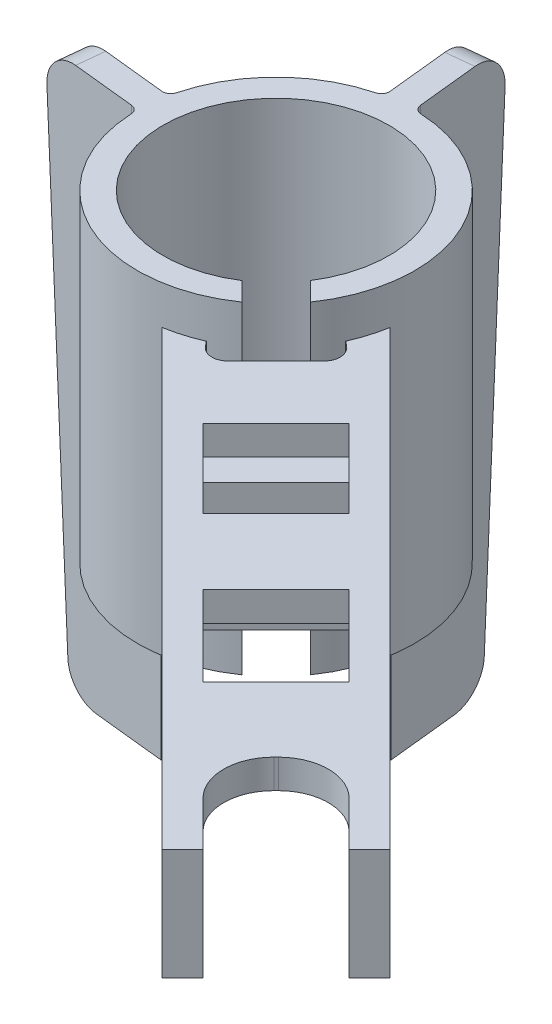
ISO-10303-21;
HEADER;
FILE_DESCRIPTION(('STEP AP214'),'2;1');
FILE_NAME('part.step','',(''),(''),'','','');
FILE_SCHEMA(('AUTOMOTIVE_DESIGN { 1 0 10303 214 1 1 1 1 }'));
ENDSEC;
DATA;
#1=APPLICATION_CONTEXT('core data for automotive mechanical design processes');
#2=APPLICATION_PROTOCOL_DEFINITION('international standard','automotive_design',2000,#1);
#3=PRODUCT_CONTEXT('',#1,'mechanical');
#4=PRODUCT('Part','Part','',(#3));
#5=PRODUCT_RELATED_PRODUCT_CATEGORY('part','',(#4));
#6=PRODUCT_DEFINITION_FORMATION('','',#4);
#7=PRODUCT_DEFINITION_CONTEXT('part definition',#1,'design');
#8=PRODUCT_DEFINITION('design','',#6,#7);
#9=PRODUCT_DEFINITION_SHAPE('','',#8);
#10=(LENGTH_UNIT() NAMED_UNIT(*) SI_UNIT(.MILLI.,.METRE.));
#11=(NAMED_UNIT(*) PLANE_ANGLE_UNIT() SI_UNIT($,.RADIAN.));
#12=(NAMED_UNIT(*) SI_UNIT($,.STERADIAN.) SOLID_ANGLE_UNIT());
#13=UNCERTAINTY_MEASURE_WITH_UNIT(LENGTH_MEASURE(1.E-05),#10,'distance_accuracy_value','');
#14=(GEOMETRIC_REPRESENTATION_CONTEXT(3) GLOBAL_UNCERTAINTY_ASSIGNED_CONTEXT((#13)) GLOBAL_UNIT_ASSIGNED_CONTEXT((#10,
#11,#12)) REPRESENTATION_CONTEXT('',''));
#15=CARTESIAN_POINT('',(0.,0.,0.));
#16=DIRECTION('',(0.,0.,1.));
#17=DIRECTION('',(1.,0.,0.));
#18=AXIS2_PLACEMENT_3D('',#15,#16,#17);
#19=CARTESIAN_POINT('',(15.344217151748,-3.75,17.6069588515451));
#20=DIRECTION('',(0.,1.,0.));
#21=DIRECTION('',(-1.,0.,0.));
#22=AXIS2_PLACEMENT_3D('',#19,#20,#21);
#23=PLANE('',#22);
#24=DIRECTION('',(0.707106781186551,0.,-0.707106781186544));
#25=VECTOR('',#24,1.);
#26=CARTESIAN_POINT('',(2.95217081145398,-3.75,5.21491251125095));
#27=LINE('',#26,#25);
#28=CARTESIAN_POINT('',(2.95217081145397,-3.75,5.21491251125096));
#29=VERTEX_POINT('',#28);
#30=CARTESIAN_POINT('',(5.21491251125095,-3.75,2.95217081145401));
#31=VERTEX_POINT('',#30);
#32=EDGE_CURVE('E469',#29,#31,#27,.T.);
#33=ORIENTED_EDGE('',*,*,#32,.T.);
#34=DIRECTION('',(-0.707106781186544,0.,-0.707106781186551));
#35=VECTOR('',#34,1.);
#36=CARTESIAN_POINT('',(17.606958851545,-3.75,15.3442171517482));
#37=LINE('',#36,#35);
#38=CARTESIAN_POINT('',(3.95360400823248,-3.75,1.69086230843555));
#39=VERTEX_POINT('',#38);
#40=EDGE_CURVE('E478',#31,#39,#37,.T.);
#41=ORIENTED_EDGE('',*,*,#40,.T.);
#42=CARTESIAN_POINT('',(0.,-3.75,0.));
#43=DIRECTION('',(0.,1.,0.));
#44=DIRECTION('',(-1.,0.,0.));
#45=AXIS2_PLACEMENT_3D('',#42,#43,#44);
#46=CIRCLE('',#45,4.3);
#47=CARTESIAN_POINT('',(3.92206738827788,-3.75,1.76277831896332));
#48=VERTEX_POINT('',#47);
#49=EDGE_CURVE('E543',#39,#48,#46,.F.);
#50=ORIENTED_EDGE('',*,*,#49,.T.);
#51=DIRECTION('',(-0.771986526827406,0.,-0.63563889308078));
#52=VECTOR('',#51,1.);
#53=CARTESIAN_POINT('',(18.5040615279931,-3.75,13.7693124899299));
#54=LINE('',#53,#52);
#55=CARTESIAN_POINT('',(4.0826172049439,-3.75,1.89497195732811));
#56=VERTEX_POINT('',#55);
#57=EDGE_CURVE('E953',#56,#48,#54,.T.);
#58=ORIENTED_EDGE('',*,*,#57,.F.);
#59=CARTESIAN_POINT('',(3.7647977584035,-3.75,2.28096522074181));
#60=DIRECTION('',(0.,1.,0.));
#61=DIRECTION('',(-1.,0.,0.));
#62=AXIS2_PLACEMENT_3D('',#59,#60,#61);
#63=CIRCLE('',#62,0.5);
#64=CARTESIAN_POINT('',(4.11835114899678,-3.75,2.63451861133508));
#65=VERTEX_POINT('',#64);
#66=EDGE_CURVE('E951',#65,#56,#63,.T.);
#67=ORIENTED_EDGE('',*,*,#66,.F.);
#68=DIRECTION('',(0.707106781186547,0.,-0.707106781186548));
#69=VECTOR('',#68,1.);
#70=CARTESIAN_POINT('',(2.24506403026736,-3.75,4.5078057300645));
#71=LINE('',#70,#69);
#72=CARTESIAN_POINT('',(2.63451861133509,-3.75,4.11835114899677));
#73=VERTEX_POINT('',#72);
#74=EDGE_CURVE('E949',#73,#65,#71,.T.);
#75=ORIENTED_EDGE('',*,*,#74,.F.);
#76=CARTESIAN_POINT('',(2.28096522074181,-3.75,3.7647977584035));
#77=DIRECTION('',(0.,1.,0.));
#78=DIRECTION('',(-1.,0.,0.));
#79=AXIS2_PLACEMENT_3D('',#76,#77,#78);
#80=CIRCLE('',#79,0.5);
#81=CARTESIAN_POINT('',(1.89497195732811,-3.75,4.08261720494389));
#82=VERTEX_POINT('',#81);
#83=EDGE_CURVE('E946',#82,#73,#80,.T.);
#84=ORIENTED_EDGE('',*,*,#83,.F.);
#85=DIRECTION('',(0.635638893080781,0.,0.771986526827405));
#86=VECTOR('',#85,1.);
#87=CARTESIAN_POINT('',(13.9654194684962,-3.75,18.7422344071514));
#88=LINE('',#87,#86);
#89=CARTESIAN_POINT('',(1.76277831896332,-3.75,3.92206738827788));
#90=VERTEX_POINT('',#89);
#91=EDGE_CURVE('E944',#90,#82,#88,.T.);
#92=ORIENTED_EDGE('',*,*,#91,.F.);
#93=CARTESIAN_POINT('',(0.,-3.75,0.));
#94=DIRECTION('',(0.,1.,0.));
#95=DIRECTION('',(-1.,0.,0.));
#96=AXIS2_PLACEMENT_3D('',#93,#94,#95);
#97=CIRCLE('',#96,4.3);
#98=CARTESIAN_POINT('',(1.69086230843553,-3.75,3.9536040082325));
#99=VERTEX_POINT('',#98);
#100=EDGE_CURVE('E881',#90,#99,#97,.F.);
#101=ORIENTED_EDGE('',*,*,#100,.T.);
#102=DIRECTION('',(-0.707106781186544,0.,-0.707106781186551));
#103=VECTOR('',#102,1.);
#104=CARTESIAN_POINT('',(15.344217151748,-3.75,17.6069588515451));
#105=LINE('',#104,#103);
#106=EDGE_CURVE('E481',#29,#99,#105,.T.);
#107=ORIENTED_EDGE('',*,*,#106,.F.);
#108=EDGE_LOOP('',(#33,#41,#50,#58,#67,#75,#84,#92,#101,#107));
#109=FACE_BOUND('',#108,.T.);
#110=ADVANCED_FACE('F32',(#109),#23,.T.);
#111=DIRECTION('',(-0.707106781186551,0.,0.707106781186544));
#112=VECTOR('',#111,1.);
#113=CARTESIAN_POINT('',(7.00035713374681,-3.75,4.73761543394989));
#114=LINE('',#113,#112);
#115=CARTESIAN_POINT('',(7.00035713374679,-3.75,4.7376154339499));
#116=VERTEX_POINT('',#115);
#117=CARTESIAN_POINT('',(4.73761543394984,-3.75,7.00035713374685));
#118=VERTEX_POINT('',#117);
#119=EDGE_CURVE('E473',#116,#118,#114,.T.);
#120=ORIENTED_EDGE('',*,*,#119,.T.);
#121=CARTESIAN_POINT('',(6.01040764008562,-3.75,8.27314933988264));
#122=VERTEX_POINT('',#121);
#123=EDGE_CURVE('E504',#122,#118,#105,.T.);
#124=ORIENTED_EDGE('',*,*,#123,.F.);
#125=DIRECTION('',(0.707106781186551,0.,-0.707106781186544));
#126=VECTOR('',#125,1.);
#127=CARTESIAN_POINT('',(8.27314933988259,-3.75,6.01040764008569));
#128=LINE('',#127,#126);
#129=CARTESIAN_POINT('',(8.27314933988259,-3.75,6.01040764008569));
#130=VERTEX_POINT('',#129);
#131=EDGE_CURVE('E1187',#122,#130,#128,.T.);
#132=ORIENTED_EDGE('',*,*,#131,.T.);
#133=EDGE_CURVE('E489',#130,#116,#37,.T.);
#134=ORIENTED_EDGE('',*,*,#133,.T.);
#135=EDGE_LOOP('',(#120,#124,#132,#134));
#136=FACE_BOUND('',#135,.T.);
#137=ADVANCED_FACE('F1068',(#136),#23,.T.);
#138=CARTESIAN_POINT('',(16.4755880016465,0.,16.4755880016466));
#139=DIRECTION('',(-0.707106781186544,0.,-0.707106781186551));
#140=DIRECTION('',(-0.707106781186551,0.,0.707106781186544));
#141=AXIS2_PLACEMENT_3D('',#138,#139,#140);
#142=PLANE('',#141);
#143=DIRECTION('',(0.,1.,0.));
#144=VECTOR('',#143,1.);
#145=CARTESIAN_POINT('',(17.606958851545,-2.1,15.3442171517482));
#146=LINE('',#145,#144);
#147=CARTESIAN_POINT('',(17.606958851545,-4.65,15.3442171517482));
#148=VERTEX_POINT('',#147);
#149=CARTESIAN_POINT('',(17.6069588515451,-1.2,15.3442171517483));
#150=VERTEX_POINT('',#149);
#151=EDGE_CURVE('E1041',#148,#150,#146,.T.);
#152=ORIENTED_EDGE('',*,*,#151,.F.);
#153=DIRECTION('',(0.707106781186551,0.,-0.707106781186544));
#154=VECTOR('',#153,1.);
#155=CARTESIAN_POINT('',(14.7078210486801,-4.65,18.243354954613));
#156=LINE('',#155,#154);
#157=CARTESIAN_POINT('',(18.2433549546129,-4.65,14.7078210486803));
#158=VERTEX_POINT('',#157);
#159=EDGE_CURVE('E511',#148,#158,#156,.T.);
#160=ORIENTED_EDGE('',*,*,#159,.T.);
#161=DIRECTION('',(0.,1.,0.));
#162=VECTOR('',#161,1.);
#163=CARTESIAN_POINT('',(18.2433549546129,-1.2,14.7078210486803));
#164=LINE('',#163,#162);
#165=CARTESIAN_POINT('',(18.2433549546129,-1.2,14.7078210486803));
#166=VERTEX_POINT('',#165);
#167=EDGE_CURVE('E520',#158,#166,#164,.T.);
#168=ORIENTED_EDGE('',*,*,#167,.T.);
#169=DIRECTION('',(-0.707106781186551,0.,0.707106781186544));
#170=VECTOR('',#169,1.);
#171=CARTESIAN_POINT('',(14.7078210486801,-1.2,18.243354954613));
#172=LINE('',#171,#170);
#173=EDGE_CURVE('E524',#166,#150,#172,.T.);
#174=ORIENTED_EDGE('',*,*,#173,.T.);
#175=EDGE_LOOP('',(#152,#160,#168,#174));
#176=FACE_BOUND('',#175,.T.);
#177=ADVANCED_FACE('F1077',(#176),#142,.F.);
#178=CARTESIAN_POINT('',(15.344217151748,-2.1,17.6069588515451));
#179=DIRECTION('',(0.,-1.,0.));
#180=DIRECTION('',(1.,0.,0.));
#181=AXIS2_PLACEMENT_3D('',#178,#179,#180);
#182=PLANE('',#181);
#183=DIRECTION('',(0.707106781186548,0.,-0.707106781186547));
#184=VECTOR('',#183,1.);
#185=CARTESIAN_POINT('',(8.59134739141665,-2.1,6.32860569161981));
#186=LINE('',#185,#184);
#187=CARTESIAN_POINT('',(6.32860569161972,-2.1,8.59134739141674));
#188=VERTEX_POINT('',#187);
#189=CARTESIAN_POINT('',(8.59134739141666,-2.1,6.32860569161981));
#190=VERTEX_POINT('',#189);
#191=EDGE_CURVE('E973',#188,#190,#186,.T.);
#192=ORIENTED_EDGE('',*,*,#191,.T.);
#193=DIRECTION('',(-0.707106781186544,0.,-0.707106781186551));
#194=VECTOR('',#193,1.);
#195=CARTESIAN_POINT('',(17.606958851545,-2.1,15.3442171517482));
#196=LINE('',#195,#194);
#197=CARTESIAN_POINT('',(10.6419570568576,-2.1,8.37921535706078));
#198=VERTEX_POINT('',#197);
#199=EDGE_CURVE('E495',#198,#190,#196,.T.);
#200=ORIENTED_EDGE('',*,*,#199,.F.);
#201=DIRECTION('',(-0.707106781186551,0.,0.707106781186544));
#202=VECTOR('',#201,1.);
#203=CARTESIAN_POINT('',(8.37921535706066,-2.1,10.6419570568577));
#204=LINE('',#203,#202);
#205=CARTESIAN_POINT('',(8.37921535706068,-2.1,10.6419570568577));
#206=VERTEX_POINT('',#205);
#207=EDGE_CURVE('E981',#198,#206,#204,.T.);
#208=ORIENTED_EDGE('',*,*,#207,.T.);
#209=DIRECTION('',(-0.707106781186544,0.,-0.707106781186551));
#210=VECTOR('',#209,1.);
#211=CARTESIAN_POINT('',(15.344217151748,-2.1,17.6069588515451));
#212=LINE('',#211,#210);
#213=EDGE_CURVE('E1046',#206,#188,#212,.T.);
#214=ORIENTED_EDGE('',*,*,#213,.T.);
#215=EDGE_LOOP('',(#192,#200,#208,#214));
#216=FACE_BOUND('',#215,.T.);
#217=ADVANCED_FACE('F1085',(#216),#182,.T.);
#218=DIRECTION('',(0.707106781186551,0.,-0.707106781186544));
#219=VECTOR('',#218,1.);
#220=CARTESIAN_POINT('',(13.1168307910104,-2.1,10.8540890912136));
#221=LINE('',#220,#219);
#222=CARTESIAN_POINT('',(10.8540890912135,-2.1,13.1168307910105));
#223=VERTEX_POINT('',#222);
#224=CARTESIAN_POINT('',(13.1168307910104,-2.1,10.8540890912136));
#225=VERTEX_POINT('',#224);
#226=EDGE_CURVE('E999',#223,#225,#221,.T.);
#227=ORIENTED_EDGE('',*,*,#226,.T.);
#228=CARTESIAN_POINT('',(16.2281006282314,-2.1,13.9653589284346));
#229=VERTEX_POINT('',#228);
#230=EDGE_CURVE('E490',#229,#225,#196,.T.);
#231=ORIENTED_EDGE('',*,*,#230,.F.);
#232=CARTESIAN_POINT('',(15.1320851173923,-2.1,15.0613744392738));
#233=DIRECTION('',(0.,-1.,0.));
#234=DIRECTION('',(1.,0.,0.));
#235=AXIS2_PLACEMENT_3D('',#232,#233,#234);
#236=CIRCLE('',#235,1.55);
#237=CARTESIAN_POINT('',(14.0360696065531,-2.1,13.9653589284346));
#238=VERTEX_POINT('',#237);
#239=EDGE_CURVE('E1007',#229,#238,#236,.F.);
#240=ORIENTED_EDGE('',*,*,#239,.T.);
#241=DIRECTION('',(-0.707106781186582,0.,0.707106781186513));
#242=VECTOR('',#241,1.);
#243=CARTESIAN_POINT('',(13.9653589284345,-2.1,14.0360696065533));
#244=LINE('',#243,#242);
#245=CARTESIAN_POINT('',(13.9653589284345,-2.1,14.0360696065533));
#246=VERTEX_POINT('',#245);
#247=EDGE_CURVE('E1010',#238,#246,#244,.T.);
#248=ORIENTED_EDGE('',*,*,#247,.T.);
#249=CARTESIAN_POINT('',(15.0613744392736,-2.1,15.1320851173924));
#250=DIRECTION('',(0.,-1.,0.));
#251=DIRECTION('',(1.,0.,0.));
#252=AXIS2_PLACEMENT_3D('',#249,#250,#251);
#253=CIRCLE('',#252,1.55);
#254=CARTESIAN_POINT('',(13.9653589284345,-2.1,16.2281006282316));
#255=VERTEX_POINT('',#254);
#256=EDGE_CURVE('E1013',#246,#255,#253,.F.);
#257=ORIENTED_EDGE('',*,*,#256,.T.);
#258=EDGE_CURVE('E1044',#255,#223,#212,.T.);
#259=ORIENTED_EDGE('',*,*,#258,.T.);
#260=EDGE_LOOP('',(#227,#231,#240,#248,#257,#259));
#261=FACE_BOUND('',#260,.T.);
#262=ADVANCED_FACE('F1086',(#261),#182,.T.);
#263=CARTESIAN_POINT('',(-7.5033388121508,-10.,-0.361291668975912));
#264=DIRECTION('',(-0.104528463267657,0.,0.994521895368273));
#265=DIRECTION('',(0.994521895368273,0.,0.104528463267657));
#266=AXIS2_PLACEMENT_3D('',#263,#264,#265);
#267=PLANE('',#266);
#268=CARTESIAN_POINT('',(-6.45932777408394,-1.,-0.251561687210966));
#269=DIRECTION('',(0.104528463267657,0.,-0.994521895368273));
#270=DIRECTION('',(0.994521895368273,0.,0.104528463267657));
#271=AXIS2_PLACEMENT_3D('',#268,#269,#270);
#272=CIRCLE('',#271,1.);
#273=CARTESIAN_POINT('',(-7.45267808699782,-1.04852508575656,-0.355967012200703));
#274=VERTEX_POINT('',#273);
#275=CARTESIAN_POINT('',(-6.45932777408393,0.,-0.251561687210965));
#276=VERTEX_POINT('',#275);
#277=EDGE_CURVE('E596',#274,#276,#272,.T.);
#278=ORIENTED_EDGE('',*,*,#277,.F.);
#279=DIRECTION('',(-0.0482592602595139,0.998821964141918,-0.00507225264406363));
#280=VECTOR('',#279,1.);
#281=CARTESIAN_POINT('',(-7.45267808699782,-1.04852508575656,-0.355967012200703));
#282=LINE('',#281,#280);
#283=CARTESIAN_POINT('',(-6.72793541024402,-16.0485250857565,-0.279793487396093));
#284=VERTEX_POINT('',#283);
#285=EDGE_CURVE('E593',#284,#274,#282,.T.);
#286=ORIENTED_EDGE('',*,*,#285,.F.);
#287=CARTESIAN_POINT('',(-5.73458509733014,-16.,-0.175388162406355));
#288=DIRECTION('',(0.104528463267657,0.,-0.994521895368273));
#289=DIRECTION('',(-0.994521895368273,0.,-0.104528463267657));
#290=AXIS2_PLACEMENT_3D('',#287,#288,#289);
#291=CIRCLE('',#290,1.);
#292=CARTESIAN_POINT('',(-5.73458509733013,-17.,-0.175388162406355));
#293=VERTEX_POINT('',#292);
#294=EDGE_CURVE('E590',#293,#284,#291,.T.);
#295=ORIENTED_EDGE('',*,*,#294,.F.);
#296=DIRECTION('',(-0.994521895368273,0.,-0.104528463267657));
#297=VECTOR('',#296,1.);
#298=CARTESIAN_POINT('',(-7.5033388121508,-17.,-0.361291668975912));
#299=LINE('',#298,#297);
#300=CARTESIAN_POINT('',(-3.49949371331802,-17.,0.059529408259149));
#301=VERTEX_POINT('',#300);
#302=EDGE_CURVE('E621',#301,#293,#299,.T.);
#303=ORIENTED_EDGE('',*,*,#302,.F.);
#304=DIRECTION('',(0.,1.,0.));
#305=VECTOR('',#304,1.);
#306=CARTESIAN_POINT('',(-3.49949371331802,-17.,0.059529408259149));
#307=LINE('',#306,#305);
#308=CARTESIAN_POINT('',(-3.49949371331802,-10.,0.0595294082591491));
#309=VERTEX_POINT('',#308);
#310=EDGE_CURVE('E624',#301,#309,#307,.T.);
#311=ORIENTED_EDGE('',*,*,#310,.T.);
#312=DIRECTION('',(-0.994521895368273,0.,-0.104528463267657));
#313=VECTOR('',#312,1.);
#314=CARTESIAN_POINT('',(-7.5033388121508,-10.,-0.361291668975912));
#315=LINE('',#314,#313);
#316=CARTESIAN_POINT('',(-4.51942779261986,-10.,-0.0476699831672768));
#317=VERTEX_POINT('',#316);
#318=EDGE_CURVE('E616',#309,#317,#315,.T.);
#319=ORIENTED_EDGE('',*,*,#318,.T.);
#320=DIRECTION('',(0.,1.,0.));
#321=VECTOR('',#320,1.);
#322=CARTESIAN_POINT('',(-4.51942779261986,-10.,-0.0476699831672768));
#323=LINE('',#322,#321);
#324=CARTESIAN_POINT('',(-4.51942779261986,0.,-0.0476699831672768));
#325=VERTEX_POINT('',#324);
#326=EDGE_CURVE('E647',#317,#325,#323,.T.);
#327=ORIENTED_EDGE('',*,*,#326,.T.);
#328=DIRECTION('',(0.994521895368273,0.,0.104528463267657));
#329=VECTOR('',#328,1.);
#330=CARTESIAN_POINT('',(-7.5033388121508,0.,-0.361291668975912));
#331=LINE('',#330,#329);
#332=EDGE_CURVE('E735',#276,#325,#331,.T.);
#333=ORIENTED_EDGE('',*,*,#332,.F.);
#334=EDGE_LOOP('',(#278,#286,#295,#303,#311,#319,#327,#333));
#335=FACE_BOUND('',#334,.T.);
#336=ADVANCED_FACE('F827',(#335),#267,.T.);
#337=CARTESIAN_POINT('',(-7.41448961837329,-10.,-1.20663528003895));
#338=DIRECTION('',(0.104528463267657,0.,-0.994521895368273));
#339=DIRECTION('',(-0.994521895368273,0.,-0.104528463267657));
#340=AXIS2_PLACEMENT_3D('',#337,#338,#339);
#341=PLANE('',#340);
#342=CARTESIAN_POINT('',(-6.37047858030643,-1.,-1.096905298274));
#343=DIRECTION('',(0.104528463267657,0.,-0.994521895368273));
#344=DIRECTION('',(-0.994521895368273,0.,-0.104528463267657));
#345=AXIS2_PLACEMENT_3D('',#342,#343,#344);
#346=CIRCLE('',#345,1.);
#347=CARTESIAN_POINT('',(-7.36382889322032,-1.04852508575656,-1.20131062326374));
#348=VERTEX_POINT('',#347);
#349=CARTESIAN_POINT('',(-6.37047858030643,0.,-1.096905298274));
#350=VERTEX_POINT('',#349);
#351=EDGE_CURVE('E587',#348,#350,#346,.T.);
#352=ORIENTED_EDGE('',*,*,#351,.T.);
#353=DIRECTION('',(-0.994521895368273,0.,-0.104528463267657));
#354=VECTOR('',#353,1.);
#355=CARTESIAN_POINT('',(-7.41448961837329,0.,-1.20663528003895));
#356=LINE('',#355,#354);
#357=CARTESIAN_POINT('',(-4.43057859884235,0.,-0.89301359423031));
#358=VERTEX_POINT('',#357);
#359=EDGE_CURVE('E737',#358,#350,#356,.T.);
#360=ORIENTED_EDGE('',*,*,#359,.F.);
#361=DIRECTION('',(0.,1.,0.));
#362=VECTOR('',#361,1.);
#363=CARTESIAN_POINT('',(-4.43057859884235,-10.,-0.89301359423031));
#364=LINE('',#363,#362);
#365=CARTESIAN_POINT('',(-4.43057859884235,-10.,-0.89301359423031));
#366=VERTEX_POINT('',#365);
#367=EDGE_CURVE('E645',#366,#358,#364,.T.);
#368=ORIENTED_EDGE('',*,*,#367,.F.);
#369=DIRECTION('',(0.994521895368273,0.,0.104528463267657));
#370=VECTOR('',#369,1.);
#371=CARTESIAN_POINT('',(-7.41448961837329,-10.,-1.20663528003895));
#372=LINE('',#371,#370);
#373=CARTESIAN_POINT('',(-3.41064451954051,-10.,-0.785814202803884));
#374=VERTEX_POINT('',#373);
#375=EDGE_CURVE('E630',#366,#374,#372,.T.);
#376=ORIENTED_EDGE('',*,*,#375,.T.);
#377=DIRECTION('',(0.,1.,0.));
#378=VECTOR('',#377,1.);
#379=CARTESIAN_POINT('',(-3.41064451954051,-17.,-0.785814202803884));
#380=LINE('',#379,#378);
#381=CARTESIAN_POINT('',(-3.41064451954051,-17.,-0.785814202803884));
#382=VERTEX_POINT('',#381);
#383=EDGE_CURVE('E639',#382,#374,#380,.T.);
#384=ORIENTED_EDGE('',*,*,#383,.F.);
#385=DIRECTION('',(0.994521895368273,0.,0.104528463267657));
#386=VECTOR('',#385,1.);
#387=CARTESIAN_POINT('',(-7.41448961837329,-17.,-1.20663528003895));
#388=LINE('',#387,#386);
#389=CARTESIAN_POINT('',(-5.64573590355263,-17.,-1.02073177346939));
#390=VERTEX_POINT('',#389);
#391=EDGE_CURVE('E617',#390,#382,#388,.T.);
#392=ORIENTED_EDGE('',*,*,#391,.F.);
#393=CARTESIAN_POINT('',(-5.64573590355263,-16.,-1.02073177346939));
#394=DIRECTION('',(0.104528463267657,0.,-0.994521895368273));
#395=DIRECTION('',(-0.994521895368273,0.,-0.104528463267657));
#396=AXIS2_PLACEMENT_3D('',#393,#394,#395);
#397=CIRCLE('',#396,1.);
#398=CARTESIAN_POINT('',(-6.63908621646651,-16.0485250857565,-1.12513709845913));
#399=VERTEX_POINT('',#398);
#400=EDGE_CURVE('E581',#390,#399,#397,.T.);
#401=ORIENTED_EDGE('',*,*,#400,.T.);
#402=DIRECTION('',(-0.0482592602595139,0.998821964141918,-0.00507225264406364));
#403=VECTOR('',#402,1.);
#404=CARTESIAN_POINT('',(-7.36382889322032,-1.04852508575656,-1.20131062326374));
#405=LINE('',#404,#403);
#406=EDGE_CURVE('E584',#399,#348,#405,.T.);
#407=ORIENTED_EDGE('',*,*,#406,.T.);
#408=EDGE_LOOP('',(#352,#360,#368,#376,#384,#392,#401,#407));
#409=FACE_BOUND('',#408,.T.);
#410=ADVANCED_FACE('F838',(#409),#341,.T.);
#411=CARTESIAN_POINT('',(0.200960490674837,0.,-4.54555990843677));
#412=DIRECTION('',(0.,-1.,0.));
#413=DIRECTION('',(0.,0.,-1.));
#414=AXIS2_PLACEMENT_3D('',#411,#412,#413);
#415=PLANE('',#414);
#416=DIRECTION('',(-0.104528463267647,0.,-0.994521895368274));
#417=VECTOR('',#416,1.);
#418=CARTESIAN_POINT('',(-0.361291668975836,0.,-7.50333881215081));
#419=LINE('',#418,#417);
#420=CARTESIAN_POINT('',(-0.0476699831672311,0.,-4.51942779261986));
#421=VERTEX_POINT('',#420);
#422=CARTESIAN_POINT('',(-0.246119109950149,0.,-6.40754511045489));
#423=VERTEX_POINT('',#422);
#424=EDGE_CURVE('E710',#421,#423,#419,.T.);
#425=ORIENTED_EDGE('',*,*,#424,.T.);
#426=DIRECTION('',(0.994521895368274,0.,-0.104528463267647));
#427=VECTOR('',#426,1.);
#428=CARTESIAN_POINT('',(-8.48930150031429,0.,-5.54115172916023));
#429=LINE('',#428,#427);
#430=CARTESIAN_POINT('',(-1.09146272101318,0.,-6.31869591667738));
#431=VERTEX_POINT('',#430);
#432=EDGE_CURVE('E553',#431,#423,#429,.T.);
#433=ORIENTED_EDGE('',*,*,#432,.F.);
#434=DIRECTION('',(0.104528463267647,0.,0.994521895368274));
#435=VECTOR('',#434,1.);
#436=CARTESIAN_POINT('',(-1.20663528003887,0.,-7.41448961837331));
#437=LINE('',#436,#435);
#438=CARTESIAN_POINT('',(-0.893013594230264,0.,-4.43057859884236));
#439=VERTEX_POINT('',#438);
#440=EDGE_CURVE('E749',#431,#439,#437,.T.);
#441=ORIENTED_EDGE('',*,*,#440,.T.);
#442=CARTESIAN_POINT('',(-1.14164406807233,0.,-4.40444648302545));
#443=DIRECTION('',(0.,-1.,0.));
#444=DIRECTION('',(0.,0.,-1.));
#445=AXIS2_PLACEMENT_3D('',#442,#443,#444);
#446=CIRCLE('',#445,0.250000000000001);
#447=CARTESIAN_POINT('',(-1.0789163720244,0.,-4.16244392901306));
#448=VERTEX_POINT('',#447);
#449=EDGE_CURVE('E746',#439,#448,#446,.T.);
#450=ORIENTED_EDGE('',*,*,#449,.T.);
#451=CARTESIAN_POINT('',(0.,0.,0.));
#452=DIRECTION('',(0.,1.,0.));
#453=DIRECTION('',(0.,0.,1.));
#454=AXIS2_PLACEMENT_3D('',#451,#452,#453);
#455=CIRCLE('',#454,4.3);
#456=CARTESIAN_POINT('',(-4.16244392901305,0.,-1.07891637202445));
#457=VERTEX_POINT('',#456);
#458=EDGE_CURVE('E743',#448,#457,#455,.T.);
#459=ORIENTED_EDGE('',*,*,#458,.T.);
#460=CARTESIAN_POINT('',(-4.40444648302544,0.,-1.14164406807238));
#461=DIRECTION('',(0.,-1.,0.));
#462=DIRECTION('',(0.,0.,-1.));
#463=AXIS2_PLACEMENT_3D('',#460,#461,#462);
#464=CIRCLE('',#463,0.25);
#465=EDGE_CURVE('E740',#457,#358,#464,.T.);
#466=ORIENTED_EDGE('',*,*,#465,.T.);
#467=ORIENTED_EDGE('',*,*,#359,.T.);
#468=DIRECTION('',(-0.104528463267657,0.,0.994521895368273));
#469=VECTOR('',#468,1.);
#470=CARTESIAN_POINT('',(-5.5877897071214,0.,-8.54369249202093));
#471=LINE('',#470,#469);
#472=EDGE_CURVE('E578',#350,#276,#471,.T.);
#473=ORIENTED_EDGE('',*,*,#472,.T.);
#474=ORIENTED_EDGE('',*,*,#332,.T.);
#475=CARTESIAN_POINT('',(-4.54555990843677,0.,0.200960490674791));
#476=DIRECTION('',(0.,-1.,0.));
#477=DIRECTION('',(0.,0.,1.));
#478=AXIS2_PLACEMENT_3D('',#475,#476,#477);
#479=CIRCLE('',#478,0.25);
#480=CARTESIAN_POINT('',(-4.29580386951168,0.,0.189918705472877));
#481=VERTEX_POINT('',#480);
#482=EDGE_CURVE('E732',#325,#481,#479,.T.);
#483=ORIENTED_EDGE('',*,*,#482,.T.);
#484=CARTESIAN_POINT('',(0.,0.,0.));
#485=DIRECTION('',(0.,1.,0.));
#486=DIRECTION('',(0.,0.,1.));
#487=AXIS2_PLACEMENT_3D('',#484,#485,#486);
#488=CIRCLE('',#487,4.3);
#489=CARTESIAN_POINT('',(2.46362215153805,0.,3.5242823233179));
#490=VERTEX_POINT('',#489);
#491=EDGE_CURVE('E729',#481,#490,#488,.T.);
#492=ORIENTED_EDGE('',*,*,#491,.T.);
#493=DIRECTION('',(-0.707106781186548,0.,-0.707106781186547));
#494=VECTOR('',#493,1.);
#495=CARTESIAN_POINT('',(2.46362215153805,0.,3.5242823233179));
#496=LINE('',#495,#494);
#497=CARTESIAN_POINT('',(1.88705486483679,0.,2.94771503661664));
#498=VERTEX_POINT('',#497);
#499=EDGE_CURVE('E726',#490,#498,#496,.T.);
#500=ORIENTED_EDGE('',*,*,#499,.T.);
#501=CARTESIAN_POINT('',(0.,0.,0.));
#502=DIRECTION('',(0.,-1.,0.));
#503=DIRECTION('',(0.,0.,1.));
#504=AXIS2_PLACEMENT_3D('',#501,#502,#503);
#505=CIRCLE('',#504,3.5);
#506=CARTESIAN_POINT('',(2.94771503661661,0.,1.88705486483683));
#507=VERTEX_POINT('',#506);
#508=EDGE_CURVE('E723',#498,#507,#505,.T.);
#509=ORIENTED_EDGE('',*,*,#508,.T.);
#510=DIRECTION('',(0.707106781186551,0.,0.707106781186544));
#511=VECTOR('',#510,1.);
#512=CARTESIAN_POINT('',(3.52428232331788,0.,2.46362215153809));
#513=LINE('',#512,#511);
#514=CARTESIAN_POINT('',(3.52428232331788,0.,2.46362215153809));
#515=VERTEX_POINT('',#514);
#516=EDGE_CURVE('E720',#507,#515,#513,.T.);
#517=ORIENTED_EDGE('',*,*,#516,.T.);
#518=CARTESIAN_POINT('',(0.,0.,0.));
#519=DIRECTION('',(0.,1.,0.));
#520=DIRECTION('',(0.,0.,1.));
#521=AXIS2_PLACEMENT_3D('',#518,#519,#520);
#522=CIRCLE('',#521,4.3);
#523=CARTESIAN_POINT('',(0.189918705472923,0.,-4.29580386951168));
#524=VERTEX_POINT('',#523);
#525=EDGE_CURVE('E717',#515,#524,#522,.T.);
#526=ORIENTED_EDGE('',*,*,#525,.T.);
#527=CARTESIAN_POINT('',(0.200960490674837,0.,-4.54555990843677));
#528=DIRECTION('',(0.,-1.,0.));
#529=DIRECTION('',(0.,0.,-1.));
#530=AXIS2_PLACEMENT_3D('',#527,#528,#529);
#531=CIRCLE('',#530,0.25);
#532=EDGE_CURVE('E714',#524,#421,#531,.T.);
#533=ORIENTED_EDGE('',*,*,#532,.T.);
#534=EDGE_LOOP('',(#425,#433,#441,#450,#459,#466,#467,#473,#474,#483,#492,#500,#509,#517,#526,#533));
#535=FACE_BOUND('',#534,.T.);
#536=ADVANCED_FACE('F774',(#535),#415,.F.);
#537=CARTESIAN_POINT('',(0.,-17.,0.));
#538=DIRECTION('',(0.,-1.,0.));
#539=DIRECTION('',(0.,0.,-1.));
#540=AXIS2_PLACEMENT_3D('',#537,#538,#539);
#541=PLANE('',#540);
#542=ORIENTED_EDGE('',*,*,#302,.T.);
#543=DIRECTION('',(-0.104528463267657,0.,0.994521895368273));
#544=VECTOR('',#543,1.);
#545=CARTESIAN_POINT('',(-4.8630470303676,-17.,-8.46751896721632));
#546=LINE('',#545,#544);
#547=EDGE_CURVE('E575',#390,#293,#546,.T.);
#548=ORIENTED_EDGE('',*,*,#547,.F.);
#549=ORIENTED_EDGE('',*,*,#391,.T.);
#550=CARTESIAN_POINT('',(0.,-17.,0.));
#551=DIRECTION('',(0.,1.,0.));
#552=DIRECTION('',(0.,0.,-1.));
#553=AXIS2_PLACEMENT_3D('',#550,#551,#552);
#554=CIRCLE('',#553,3.5);
#555=EDGE_CURVE('E619',#382,#301,#554,.T.);
#556=ORIENTED_EDGE('',*,*,#555,.T.);
#557=EDGE_LOOP('',(#542,#548,#549,#556));
#558=FACE_BOUND('',#557,.T.);
#559=ADVANCED_FACE('F832',(#558),#541,.T.);
#560=CARTESIAN_POINT('',(0.200960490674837,-10.,-4.54555990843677));
#561=DIRECTION('',(0.,-1.,0.));
#562=DIRECTION('',(0.,0.,-1.));
#563=AXIS2_PLACEMENT_3D('',#560,#561,#562);
#564=PLANE('',#563);
#565=CARTESIAN_POINT('',(0.,-10.,0.));
#566=DIRECTION('',(0.,-1.,0.));
#567=DIRECTION('',(0.,0.,1.));
#568=AXIS2_PLACEMENT_3D('',#565,#566,#567);
#569=CIRCLE('',#568,3.5);
#570=CARTESIAN_POINT('',(0.0595294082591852,-10.,-3.49949371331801));
#571=VERTEX_POINT('',#570);
#572=CARTESIAN_POINT('',(2.94771503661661,-10.,1.88705486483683));
#573=VERTEX_POINT('',#572);
#574=EDGE_CURVE('E672',#571,#573,#569,.T.);
#575=ORIENTED_EDGE('',*,*,#574,.F.);
#576=DIRECTION('',(-0.104528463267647,0.,-0.994521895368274));
#577=VECTOR('',#576,1.);
#578=CARTESIAN_POINT('',(-0.0476699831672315,-10.,-4.51942779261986));
#579=LINE('',#578,#577);
#580=CARTESIAN_POINT('',(-0.0476699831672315,-10.,-4.51942779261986));
#581=VERTEX_POINT('',#580);
#582=EDGE_CURVE('E634',#571,#581,#579,.T.);
#583=ORIENTED_EDGE('',*,*,#582,.T.);
#584=CARTESIAN_POINT('',(0.200960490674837,-10.,-4.54555990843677));
#585=DIRECTION('',(0.,-1.,0.));
#586=DIRECTION('',(0.,0.,-1.));
#587=AXIS2_PLACEMENT_3D('',#584,#585,#586);
#588=CIRCLE('',#587,0.25);
#589=CARTESIAN_POINT('',(0.189918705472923,-10.,-4.29580386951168));
#590=VERTEX_POINT('',#589);
#591=EDGE_CURVE('E691',#590,#581,#588,.T.);
#592=ORIENTED_EDGE('',*,*,#591,.F.);
#593=CARTESIAN_POINT('',(0.,-10.,0.));
#594=DIRECTION('',(0.,1.,0.));
#595=DIRECTION('',(0.,0.,1.));
#596=AXIS2_PLACEMENT_3D('',#593,#594,#595);
#597=CIRCLE('',#596,4.3);
#598=CARTESIAN_POINT('',(3.52428232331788,-10.,2.46362215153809));
#599=VERTEX_POINT('',#598);
#600=EDGE_CURVE('E753',#599,#590,#597,.T.);
#601=ORIENTED_EDGE('',*,*,#600,.F.);
#602=DIRECTION('',(0.707106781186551,0.,0.707106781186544));
#603=VECTOR('',#602,1.);
#604=CARTESIAN_POINT('',(3.52428232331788,-10.,2.46362215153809));
#605=LINE('',#604,#603);
#606=EDGE_CURVE('E680',#573,#599,#605,.T.);
#607=ORIENTED_EDGE('',*,*,#606,.F.);
#608=EDGE_LOOP('',(#575,#583,#592,#601,#607));
#609=FACE_BOUND('',#608,.T.);
#610=ADVANCED_FACE('F766',(#609),#564,.T.);
#611=CARTESIAN_POINT('',(-1.14164406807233,-10.,-4.40444648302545));
#612=DIRECTION('',(0.,-1.,0.));
#613=DIRECTION('',(0.,0.,-1.));
#614=AXIS2_PLACEMENT_3D('',#611,#612,#613);
#615=CIRCLE('',#614,0.250000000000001);
#616=CARTESIAN_POINT('',(-0.893013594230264,-10.,-4.43057859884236));
#617=VERTEX_POINT('',#616);
#618=CARTESIAN_POINT('',(-1.0789163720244,-10.,-4.16244392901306));
#619=VERTEX_POINT('',#618);
#620=EDGE_CURVE('E713',#617,#619,#615,.T.);
#621=ORIENTED_EDGE('',*,*,#620,.F.);
#622=DIRECTION('',(-0.104528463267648,0.,-0.994521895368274));
#623=VECTOR('',#622,1.);
#624=CARTESIAN_POINT('',(-1.20663528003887,-10.,-7.41448961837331));
#625=LINE('',#624,#623);
#626=CARTESIAN_POINT('',(-0.785814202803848,-10.,-3.41064451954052));
#627=VERTEX_POINT('',#626);
#628=EDGE_CURVE('E601',#627,#617,#625,.T.);
#629=ORIENTED_EDGE('',*,*,#628,.F.);
#630=EDGE_CURVE('E636',#374,#627,#569,.T.);
#631=ORIENTED_EDGE('',*,*,#630,.F.);
#632=ORIENTED_EDGE('',*,*,#375,.F.);
#633=CARTESIAN_POINT('',(-4.40444648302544,-10.,-1.14164406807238));
#634=DIRECTION('',(0.,-1.,0.));
#635=DIRECTION('',(0.,0.,-1.));
#636=AXIS2_PLACEMENT_3D('',#633,#634,#635);
#637=CIRCLE('',#636,0.25);
#638=CARTESIAN_POINT('',(-4.16244392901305,-10.,-1.07891637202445));
#639=VERTEX_POINT('',#638);
#640=EDGE_CURVE('E651',#639,#366,#637,.T.);
#641=ORIENTED_EDGE('',*,*,#640,.F.);
#642=CARTESIAN_POINT('',(0.,-10.,0.));
#643=DIRECTION('',(0.,1.,0.));
#644=DIRECTION('',(0.,0.,1.));
#645=AXIS2_PLACEMENT_3D('',#642,#643,#644);
#646=CIRCLE('',#645,4.3);
#647=EDGE_CURVE('E655',#619,#639,#646,.T.);
#648=ORIENTED_EDGE('',*,*,#647,.F.);
#649=EDGE_LOOP('',(#621,#629,#631,#632,#641,#648));
#650=FACE_BOUND('',#649,.T.);
#651=ADVANCED_FACE('F844',(#650),#564,.T.);
#652=ORIENTED_EDGE('',*,*,#318,.F.);
#653=CARTESIAN_POINT('',(1.88705486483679,-10.,2.94771503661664));
#654=VERTEX_POINT('',#653);
#655=EDGE_CURVE('E684',#654,#309,#569,.T.);
#656=ORIENTED_EDGE('',*,*,#655,.F.);
#657=DIRECTION('',(-0.707106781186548,0.,-0.707106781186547));
#658=VECTOR('',#657,1.);
#659=CARTESIAN_POINT('',(2.46362215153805,-10.,3.5242823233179));
#660=LINE('',#659,#658);
#661=CARTESIAN_POINT('',(2.46362215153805,-10.,3.5242823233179));
#662=VERTEX_POINT('',#661);
#663=EDGE_CURVE('E674',#662,#654,#660,.T.);
#664=ORIENTED_EDGE('',*,*,#663,.F.);
#665=CARTESIAN_POINT('',(0.,-10.,0.));
#666=DIRECTION('',(0.,1.,0.));
#667=DIRECTION('',(0.,0.,1.));
#668=AXIS2_PLACEMENT_3D('',#665,#666,#667);
#669=CIRCLE('',#668,4.3);
#670=CARTESIAN_POINT('',(-4.29580386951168,-10.,0.189918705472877));
#671=VERTEX_POINT('',#670);
#672=EDGE_CURVE('E665',#671,#662,#669,.T.);
#673=ORIENTED_EDGE('',*,*,#672,.F.);
#674=CARTESIAN_POINT('',(-4.54555990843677,-10.,0.200960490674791));
#675=DIRECTION('',(0.,-1.,0.));
#676=DIRECTION('',(0.,0.,1.));
#677=AXIS2_PLACEMENT_3D('',#674,#675,#676);
#678=CIRCLE('',#677,0.25);
#679=EDGE_CURVE('E654',#317,#671,#678,.T.);
#680=ORIENTED_EDGE('',*,*,#679,.F.);
#681=EDGE_LOOP('',(#652,#656,#664,#673,#680));
#682=FACE_BOUND('',#681,.T.);
#683=ADVANCED_FACE('F816',(#682),#564,.T.);
#684=CARTESIAN_POINT('',(0.,-10.,0.));
#685=DIRECTION('',(0.,1.,0.));
#686=DIRECTION('',(0.,0.,1.));
#687=AXIS2_PLACEMENT_3D('',#684,#685,#686);
#688=CYLINDRICAL_SURFACE('',#687,3.5);
#689=DIRECTION('',(0.,1.,0.));
#690=VECTOR('',#689,1.);
#691=CARTESIAN_POINT('',(2.94771503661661,-10.,1.88705486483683));
#692=LINE('',#691,#690);
#693=CARTESIAN_POINT('',(2.94771503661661,-8.25,1.88705486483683));
#694=VERTEX_POINT('',#693);
#695=EDGE_CURVE('E701',#694,#507,#692,.T.);
#696=ORIENTED_EDGE('',*,*,#695,.T.);
#697=ORIENTED_EDGE('',*,*,#508,.F.);
#698=DIRECTION('',(0.,1.,0.));
#699=VECTOR('',#698,1.);
#700=CARTESIAN_POINT('',(1.88705486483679,-10.,2.94771503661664));
#701=LINE('',#700,#699);
#702=CARTESIAN_POINT('',(1.88705486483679,-8.25,2.94771503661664));
#703=VERTEX_POINT('',#702);
#704=EDGE_CURVE('E697',#703,#498,#701,.T.);
#705=ORIENTED_EDGE('',*,*,#704,.F.);
#706=CARTESIAN_POINT('',(0.,-8.25,0.));
#707=DIRECTION('',(0.,-1.,0.));
#708=DIRECTION('',(0.,0.,-1.));
#709=AXIS2_PLACEMENT_3D('',#706,#707,#708);
#710=CIRCLE('',#709,3.5);
#711=EDGE_CURVE('E642',#703,#694,#710,.T.);
#712=ORIENTED_EDGE('',*,*,#711,.T.);
#713=EDGE_LOOP('',(#696,#697,#705,#712));
#714=FACE_BOUND('',#713,.T.);
#715=ADVANCED_FACE('F782',(#714),#688,.F.);
#716=CARTESIAN_POINT('',(-0.361291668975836,-10.,-7.50333881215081));
#717=DIRECTION('',(0.994521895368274,0.,-0.104528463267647));
#718=DIRECTION('',(-0.104528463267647,0.,-0.994521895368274));
#719=AXIS2_PLACEMENT_3D('',#716,#717,#718);
#720=PLANE('',#719);
#721=CARTESIAN_POINT('',(-0.170449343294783,-15.9504002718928,-5.68759537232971));
#722=DIRECTION('',(-0.994521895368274,0.,0.104528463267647));
#723=DIRECTION('',(0.104528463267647,0.,0.994521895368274));
#724=AXIS2_PLACEMENT_3D('',#721,#722,#723);
#725=CIRCLE('',#724,1.04959972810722);
#726=CARTESIAN_POINT('',(-0.280033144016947,-16.0013321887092,-6.73021559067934));
#727=VERTEX_POINT('',#726);
#728=CARTESIAN_POINT('',(-0.170449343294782,-17.,-5.68759537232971));
#729=VERTEX_POINT('',#728);
#730=EDGE_CURVE('E570',#727,#729,#725,.T.);
#731=ORIENTED_EDGE('',*,*,#730,.F.);
#732=DIRECTION('',(0.00507225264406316,-0.998821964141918,0.0482592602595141));
#733=VECTOR('',#732,1.);
#734=CARTESIAN_POINT('',(-0.355702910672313,-1.10053164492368,-7.45016532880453));
#735=LINE('',#734,#733);
#736=CARTESIAN_POINT('',(-0.355702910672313,-1.10053164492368,-7.45016532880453));
#737=VERTEX_POINT('',#736);
#738=EDGE_CURVE('E567',#737,#727,#735,.T.);
#739=ORIENTED_EDGE('',*,*,#738,.F.);
#740=CARTESIAN_POINT('',(-0.246119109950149,-1.04959972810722,-6.40754511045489));
#741=DIRECTION('',(-0.994521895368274,0.,0.104528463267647));
#742=DIRECTION('',(-0.104528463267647,0.,-0.994521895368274));
#743=AXIS2_PLACEMENT_3D('',#740,#741,#742);
#744=CIRCLE('',#743,1.04959972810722);
#745=EDGE_CURVE('E564',#423,#737,#744,.T.);
#746=ORIENTED_EDGE('',*,*,#745,.F.);
#747=ORIENTED_EDGE('',*,*,#424,.F.);
#748=DIRECTION('',(0.,1.,0.));
#749=VECTOR('',#748,1.);
#750=CARTESIAN_POINT('',(-0.0476699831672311,-10.,-4.51942779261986));
#751=LINE('',#750,#749);
#752=EDGE_CURVE('E635',#581,#421,#751,.T.);
#753=ORIENTED_EDGE('',*,*,#752,.F.);
#754=ORIENTED_EDGE('',*,*,#582,.F.);
#755=DIRECTION('',(0.,1.,0.));
#756=VECTOR('',#755,1.);
#757=CARTESIAN_POINT('',(0.0595294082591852,-17.,-3.49949371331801));
#758=LINE('',#757,#756);
#759=CARTESIAN_POINT('',(0.0595294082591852,-17.,-3.49949371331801));
#760=VERTEX_POINT('',#759);
#761=EDGE_CURVE('E613',#760,#571,#758,.T.);
#762=ORIENTED_EDGE('',*,*,#761,.F.);
#763=DIRECTION('',(0.104528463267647,0.,0.994521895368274));
#764=VECTOR('',#763,1.);
#765=CARTESIAN_POINT('',(-0.361291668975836,-17.,-7.50333881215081));
#766=LINE('',#765,#764);
#767=EDGE_CURVE('E603',#729,#760,#766,.T.);
#768=ORIENTED_EDGE('',*,*,#767,.F.);
#769=EDGE_LOOP('',(#731,#739,#746,#747,#753,#754,#762,#768));
#770=FACE_BOUND('',#769,.T.);
#771=ADVANCED_FACE('F873',(#770),#720,.T.);
#772=CARTESIAN_POINT('',(0.200960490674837,-10.,-4.54555990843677));
#773=DIRECTION('',(0.,1.,0.));
#774=DIRECTION('',(0.,0.,1.));
#775=AXIS2_PLACEMENT_3D('',#772,#773,#774);
#776=CYLINDRICAL_SURFACE('',#775,0.25);
#777=ORIENTED_EDGE('',*,*,#532,.F.);
#778=DIRECTION('',(0.,1.,0.));
#779=VECTOR('',#778,1.);
#780=CARTESIAN_POINT('',(0.189918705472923,-10.,-4.29580386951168));
#781=LINE('',#780,#779);
#782=EDGE_CURVE('E707',#590,#524,#781,.T.);
#783=ORIENTED_EDGE('',*,*,#782,.F.);
#784=ORIENTED_EDGE('',*,*,#591,.T.);
#785=ORIENTED_EDGE('',*,*,#752,.T.);
#786=EDGE_LOOP('',(#777,#783,#784,#785));
#787=FACE_BOUND('',#786,.T.);
#788=ADVANCED_FACE('F771',(#787),#776,.F.);
#789=CARTESIAN_POINT('',(0.,-10.,0.));
#790=DIRECTION('',(0.,1.,0.));
#791=DIRECTION('',(0.,0.,1.));
#792=AXIS2_PLACEMENT_3D('',#789,#790,#791);
#793=CYLINDRICAL_SURFACE('',#792,4.3);
#794=CARTESIAN_POINT('',(0.,-2.1,0.));
#795=DIRECTION('',(0.,-1.,0.));
#796=DIRECTION('',(1.,0.,0.));
#797=AXIS2_PLACEMENT_3D('',#794,#795,#796);
#798=CIRCLE('',#797,4.3);
#799=CARTESIAN_POINT('',(3.92206738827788,-2.1,1.76277831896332));
#800=VERTEX_POINT('',#799);
#801=CARTESIAN_POINT('',(3.95360400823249,-2.1,1.69086230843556));
#802=VERTEX_POINT('',#801);
#803=EDGE_CURVE('E541',#800,#802,#798,.F.);
#804=ORIENTED_EDGE('',*,*,#803,.F.);
#805=DIRECTION('',(0.,1.,0.));
#806=VECTOR('',#805,1.);
#807=CARTESIAN_POINT('',(3.92206738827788,-8.18838982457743,1.76277831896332));
#808=LINE('',#807,#806);
#809=CARTESIAN_POINT('',(3.92206738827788,-1.2,1.76277831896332));
#810=VERTEX_POINT('',#809);
#811=EDGE_CURVE('E1230',#800,#810,#808,.T.);
#812=ORIENTED_EDGE('',*,*,#811,.T.);
#813=CARTESIAN_POINT('',(0.,-1.2,0.));
#814=DIRECTION('',(0.,-1.,0.));
#815=DIRECTION('',(1.,0.,0.));
#816=AXIS2_PLACEMENT_3D('',#813,#814,#815);
#817=CIRCLE('',#816,4.3);
#818=CARTESIAN_POINT('',(4.24163032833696,-1.2,0.706096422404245));
#819=VERTEX_POINT('',#818);
#820=EDGE_CURVE('E545',#810,#819,#817,.F.);
#821=ORIENTED_EDGE('',*,*,#820,.T.);
#822=DIRECTION('',(0.,1.,0.));
#823=VECTOR('',#822,1.);
#824=CARTESIAN_POINT('',(4.24163032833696,-10.,0.706096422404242));
#825=LINE('',#824,#823);
#826=CARTESIAN_POINT('',(4.24163032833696,-4.65,0.70609642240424));
#827=VERTEX_POINT('',#826);
#828=EDGE_CURVE('E893',#819,#827,#825,.F.);
#829=ORIENTED_EDGE('',*,*,#828,.T.);
#830=CARTESIAN_POINT('',(0.,-4.65,0.));
#831=DIRECTION('',(0.,1.,0.));
#832=DIRECTION('',(0.,0.,1.));
#833=AXIS2_PLACEMENT_3D('',#830,#831,#832);
#834=CIRCLE('',#833,4.3);
#835=CARTESIAN_POINT('',(3.92206738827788,-4.65,1.76277831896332));
#836=VERTEX_POINT('',#835);
#837=EDGE_CURVE('E547',#827,#836,#834,.F.);
#838=ORIENTED_EDGE('',*,*,#837,.T.);
#839=EDGE_CURVE('E1212',#836,#48,#808,.T.);
#840=ORIENTED_EDGE('',*,*,#839,.T.);
#841=ORIENTED_EDGE('',*,*,#49,.F.);
#842=DIRECTION('',(0.,1.,0.));
#843=VECTOR('',#842,1.);
#844=CARTESIAN_POINT('',(3.95360400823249,-10.,1.69086230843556));
#845=LINE('',#844,#843);
#846=EDGE_CURVE('E487',#802,#39,#845,.F.);
#847=ORIENTED_EDGE('',*,*,#846,.F.);
#848=EDGE_LOOP('',(#804,#812,#821,#829,#838,#840,#841,#847));
#849=FACE_BOUND('',#848,.T.);
#850=ORIENTED_EDGE('',*,*,#525,.F.);
#851=DIRECTION('',(0.,1.,0.));
#852=VECTOR('',#851,1.);
#853=CARTESIAN_POINT('',(3.52428232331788,-10.,2.46362215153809));
#854=LINE('',#853,#852);
#855=EDGE_CURVE('E705',#599,#515,#854,.T.);
#856=ORIENTED_EDGE('',*,*,#855,.F.);
#857=ORIENTED_EDGE('',*,*,#600,.T.);
#858=ORIENTED_EDGE('',*,*,#782,.T.);
#859=EDGE_LOOP('',(#850,#856,#857,#858));
#860=FACE_BOUND('',#859,.T.);
#861=ADVANCED_FACE('F772',(#849,#860),#793,.T.);
#862=CARTESIAN_POINT('',(3.52428232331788,-10.,2.46362215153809));
#863=DIRECTION('',(-0.707106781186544,0.,0.707106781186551));
#864=DIRECTION('',(0.707106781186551,0.,0.707106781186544));
#865=AXIS2_PLACEMENT_3D('',#862,#863,#864);
#866=PLANE('',#865);
#867=ORIENTED_EDGE('',*,*,#516,.F.);
#868=ORIENTED_EDGE('',*,*,#695,.F.);
#869=DIRECTION('',(-0.707106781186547,0.,-0.707106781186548));
#870=VECTOR('',#869,1.);
#871=CARTESIAN_POINT('',(2.94771503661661,-8.25,1.88705486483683));
#872=LINE('',#871,#870);
#873=CARTESIAN_POINT('',(2.2166722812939,-8.25,1.15601210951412));
#874=VERTEX_POINT('',#873);
#875=EDGE_CURVE('E778',#694,#874,#872,.T.);
#876=ORIENTED_EDGE('',*,*,#875,.T.);
#877=DIRECTION('',(0.,1.,0.));
#878=VECTOR('',#877,1.);
#879=CARTESIAN_POINT('',(2.2166722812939,-9.25,1.15601210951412));
#880=LINE('',#879,#878);
#881=CARTESIAN_POINT('',(2.2166722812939,-9.25,1.15601210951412));
#882=VERTEX_POINT('',#881);
#883=EDGE_CURVE('E751',#882,#874,#880,.T.);
#884=ORIENTED_EDGE('',*,*,#883,.F.);
#885=DIRECTION('',(-0.707106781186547,0.,-0.707106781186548));
#886=VECTOR('',#885,1.);
#887=CARTESIAN_POINT('',(2.94771503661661,-9.25,1.88705486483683));
#888=LINE('',#887,#886);
#889=CARTESIAN_POINT('',(2.94771503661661,-9.25,1.88705486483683));
#890=VERTEX_POINT('',#889);
#891=EDGE_CURVE('E1868',#890,#882,#888,.T.);
#892=ORIENTED_EDGE('',*,*,#891,.F.);
#893=EDGE_CURVE('E702',#573,#890,#692,.T.);
#894=ORIENTED_EDGE('',*,*,#893,.F.);
#895=ORIENTED_EDGE('',*,*,#606,.T.);
#896=ORIENTED_EDGE('',*,*,#855,.T.);
#897=EDGE_LOOP('',(#867,#868,#876,#884,#892,#894,#895,#896));
#898=FACE_BOUND('',#897,.T.);
#899=ADVANCED_FACE('F762',(#898),#866,.T.);
#900=CARTESIAN_POINT('',(0.,-9.25,0.));
#901=DIRECTION('',(0.,-1.,0.));
#902=DIRECTION('',(0.,0.,-1.));
#903=AXIS2_PLACEMENT_3D('',#900,#901,#902);
#904=CIRCLE('',#903,3.5);
#905=CARTESIAN_POINT('',(1.88705486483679,-9.25,2.94771503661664));
#906=VERTEX_POINT('',#905);
#907=EDGE_CURVE('E797',#906,#890,#904,.T.);
#908=ORIENTED_EDGE('',*,*,#907,.F.);
#909=EDGE_CURVE('E698',#654,#906,#701,.T.);
#910=ORIENTED_EDGE('',*,*,#909,.F.);
#911=ORIENTED_EDGE('',*,*,#655,.T.);
#912=ORIENTED_EDGE('',*,*,#310,.F.);
#913=ORIENTED_EDGE('',*,*,#555,.F.);
#914=ORIENTED_EDGE('',*,*,#383,.T.);
#915=ORIENTED_EDGE('',*,*,#630,.T.);
#916=DIRECTION('',(0.,1.,0.));
#917=VECTOR('',#916,1.);
#918=CARTESIAN_POINT('',(-0.785814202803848,-17.,-3.41064451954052));
#919=LINE('',#918,#917);
#920=CARTESIAN_POINT('',(-0.785814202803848,-17.,-3.41064451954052));
#921=VERTEX_POINT('',#920);
#922=EDGE_CURVE('E610',#921,#627,#919,.T.);
#923=ORIENTED_EDGE('',*,*,#922,.F.);
#924=CARTESIAN_POINT('',(0.,-17.,0.));
#925=DIRECTION('',(0.,1.,0.));
#926=DIRECTION('',(0.,0.,-1.));
#927=AXIS2_PLACEMENT_3D('',#924,#925,#926);
#928=CIRCLE('',#927,3.5);
#929=EDGE_CURVE('E605',#760,#921,#928,.T.);
#930=ORIENTED_EDGE('',*,*,#929,.F.);
#931=ORIENTED_EDGE('',*,*,#761,.T.);
#932=ORIENTED_EDGE('',*,*,#574,.T.);
#933=ORIENTED_EDGE('',*,*,#893,.T.);
#934=EDGE_LOOP('',(#908,#910,#911,#912,#913,#914,#915,#923,#930,#931,#932,#933));
#935=FACE_BOUND('',#934,.T.);
#936=ADVANCED_FACE('F822',(#935),#688,.F.);
#937=CARTESIAN_POINT('',(2.46362215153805,-10.,3.5242823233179));
#938=DIRECTION('',(0.707106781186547,0.,-0.707106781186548));
#939=DIRECTION('',(-0.707106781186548,0.,-0.707106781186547));
#940=AXIS2_PLACEMENT_3D('',#937,#938,#939);
#941=PLANE('',#940);
#942=ORIENTED_EDGE('',*,*,#499,.F.);
#943=DIRECTION('',(0.,1.,0.));
#944=VECTOR('',#943,1.);
#945=CARTESIAN_POINT('',(2.46362215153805,-10.,3.5242823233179));
#946=LINE('',#945,#944);
#947=EDGE_CURVE('E695',#662,#490,#946,.T.);
#948=ORIENTED_EDGE('',*,*,#947,.F.);
#949=ORIENTED_EDGE('',*,*,#663,.T.);
#950=ORIENTED_EDGE('',*,*,#909,.T.);
#951=DIRECTION('',(0.707106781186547,0.,0.707106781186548));
#952=VECTOR('',#951,1.);
#953=CARTESIAN_POINT('',(1.88705486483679,-9.25,2.94771503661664));
#954=LINE('',#953,#952);
#955=CARTESIAN_POINT('',(1.15601210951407,-9.25,2.21667228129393));
#956=VERTEX_POINT('',#955);
#957=EDGE_CURVE('E791',#956,#906,#954,.T.);
#958=ORIENTED_EDGE('',*,*,#957,.F.);
#959=DIRECTION('',(0.,1.,0.));
#960=VECTOR('',#959,1.);
#961=CARTESIAN_POINT('',(1.15601210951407,-9.25,2.21667228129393));
#962=LINE('',#961,#960);
#963=CARTESIAN_POINT('',(1.15601210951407,-8.25,2.21667228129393));
#964=VERTEX_POINT('',#963);
#965=EDGE_CURVE('E798',#956,#964,#962,.T.);
#966=ORIENTED_EDGE('',*,*,#965,.T.);
#967=DIRECTION('',(0.707106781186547,0.,0.707106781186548));
#968=VECTOR('',#967,1.);
#969=CARTESIAN_POINT('',(1.88705486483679,-8.25,2.94771503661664));
#970=LINE('',#969,#968);
#971=EDGE_CURVE('E795',#964,#703,#970,.T.);
#972=ORIENTED_EDGE('',*,*,#971,.T.);
#973=ORIENTED_EDGE('',*,*,#704,.T.);
#974=EDGE_LOOP('',(#942,#948,#949,#950,#958,#966,#972,#973));
#975=FACE_BOUND('',#974,.T.);
#976=ADVANCED_FACE('F812',(#975),#941,.T.);
#977=CARTESIAN_POINT('',(0.,-10.,0.));
#978=DIRECTION('',(0.,1.,0.));
#979=DIRECTION('',(0.,0.,1.));
#980=AXIS2_PLACEMENT_3D('',#977,#978,#979);
#981=CYLINDRICAL_SURFACE('',#980,4.3);
#982=ORIENTED_EDGE('',*,*,#100,.F.);
#983=DIRECTION('',(0.,1.,0.));
#984=VECTOR('',#983,1.);
#985=CARTESIAN_POINT('',(1.76277831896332,-8.18838982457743,3.92206738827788));
#986=LINE('',#985,#984);
#987=CARTESIAN_POINT('',(1.76277831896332,-4.65,3.92206738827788));
#988=VERTEX_POINT('',#987);
#989=EDGE_CURVE('E937',#988,#90,#986,.T.);
#990=ORIENTED_EDGE('',*,*,#989,.F.);
#991=CARTESIAN_POINT('',(0.,-4.65,0.));
#992=DIRECTION('',(0.,1.,0.));
#993=DIRECTION('',(0.,0.,1.));
#994=AXIS2_PLACEMENT_3D('',#991,#992,#993);
#995=CIRCLE('',#994,4.3);
#996=CARTESIAN_POINT('',(0.706096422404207,-4.65,4.24163032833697));
#997=VERTEX_POINT('',#996);
#998=EDGE_CURVE('E890',#988,#997,#995,.F.);
#999=ORIENTED_EDGE('',*,*,#998,.T.);
#1000=DIRECTION('',(0.,1.,0.));
#1001=VECTOR('',#1000,1.);
#1002=CARTESIAN_POINT('',(0.706096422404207,-10.,4.24163032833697));
#1003=LINE('',#1002,#1001);
#1004=CARTESIAN_POINT('',(0.706096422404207,-1.2,4.24163032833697));
#1005=VERTEX_POINT('',#1004);
#1006=EDGE_CURVE('E885',#997,#1005,#1003,.T.);
#1007=ORIENTED_EDGE('',*,*,#1006,.T.);
#1008=CARTESIAN_POINT('',(0.,-1.2,0.));
#1009=DIRECTION('',(0.,-1.,0.));
#1010=DIRECTION('',(1.,0.,0.));
#1011=AXIS2_PLACEMENT_3D('',#1008,#1009,#1010);
#1012=CIRCLE('',#1011,4.3);
#1013=CARTESIAN_POINT('',(1.76277831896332,-1.2,3.92206738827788));
#1014=VERTEX_POINT('',#1013);
#1015=EDGE_CURVE('E887',#1005,#1014,#1012,.F.);
#1016=ORIENTED_EDGE('',*,*,#1015,.T.);
#1017=CARTESIAN_POINT('',(1.76277831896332,-2.1,3.92206738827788));
#1018=VERTEX_POINT('',#1017);
#1019=EDGE_CURVE('E940',#1018,#1014,#986,.T.);
#1020=ORIENTED_EDGE('',*,*,#1019,.F.);
#1021=CARTESIAN_POINT('',(0.,-2.1,0.));
#1022=DIRECTION('',(0.,-1.,0.));
#1023=DIRECTION('',(1.,0.,0.));
#1024=AXIS2_PLACEMENT_3D('',#1021,#1022,#1023);
#1025=CIRCLE('',#1024,4.3);
#1026=CARTESIAN_POINT('',(1.69086230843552,-2.1,3.9536040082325));
#1027=VERTEX_POINT('',#1026);
#1028=EDGE_CURVE('E875',#1027,#1018,#1025,.F.);
#1029=ORIENTED_EDGE('',*,*,#1028,.F.);
#1030=DIRECTION('',(0.,1.,0.));
#1031=VECTOR('',#1030,1.);
#1032=CARTESIAN_POINT('',(1.69086230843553,-10.,3.9536040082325));
#1033=LINE('',#1032,#1031);
#1034=EDGE_CURVE('E877',#99,#1027,#1033,.T.);
#1035=ORIENTED_EDGE('',*,*,#1034,.F.);
#1036=EDGE_LOOP('',(#982,#990,#999,#1007,#1016,#1020,#1029,#1035));
#1037=FACE_BOUND('',#1036,.T.);
#1038=ORIENTED_EDGE('',*,*,#947,.T.);
#1039=ORIENTED_EDGE('',*,*,#491,.F.);
#1040=DIRECTION('',(0.,1.,0.));
#1041=VECTOR('',#1040,1.);
#1042=CARTESIAN_POINT('',(-4.29580386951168,-10.,0.189918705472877));
#1043=LINE('',#1042,#1041);
#1044=EDGE_CURVE('E660',#671,#481,#1043,.T.);
#1045=ORIENTED_EDGE('',*,*,#1044,.F.);
#1046=ORIENTED_EDGE('',*,*,#672,.T.);
#1047=EDGE_LOOP('',(#1038,#1039,#1045,#1046));
#1048=FACE_BOUND('',#1047,.T.);
#1049=ADVANCED_FACE('F1055',(#1037,#1048),#981,.T.);
#1050=CARTESIAN_POINT('',(-4.54555990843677,-10.,0.200960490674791));
#1051=DIRECTION('',(0.,1.,0.));
#1052=DIRECTION('',(0.,0.,1.));
#1053=AXIS2_PLACEMENT_3D('',#1050,#1051,#1052);
#1054=CYLINDRICAL_SURFACE('',#1053,0.25);
#1055=ORIENTED_EDGE('',*,*,#482,.F.);
#1056=ORIENTED_EDGE('',*,*,#326,.F.);
#1057=ORIENTED_EDGE('',*,*,#679,.T.);
#1058=ORIENTED_EDGE('',*,*,#1044,.T.);
#1059=EDGE_LOOP('',(#1055,#1056,#1057,#1058));
#1060=FACE_BOUND('',#1059,.T.);
#1061=ADVANCED_FACE('F1349',(#1060),#1054,.F.);
#1062=CARTESIAN_POINT('',(-4.40444648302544,-10.,-1.14164406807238));
#1063=DIRECTION('',(0.,1.,0.));
#1064=DIRECTION('',(0.,0.,1.));
#1065=AXIS2_PLACEMENT_3D('',#1062,#1063,#1064);
#1066=CYLINDRICAL_SURFACE('',#1065,0.25);
#1067=ORIENTED_EDGE('',*,*,#465,.F.);
#1068=DIRECTION('',(0.,1.,0.));
#1069=VECTOR('',#1068,1.);
#1070=CARTESIAN_POINT('',(-4.16244392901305,-10.,-1.07891637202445));
#1071=LINE('',#1070,#1069);
#1072=EDGE_CURVE('E648',#639,#457,#1071,.T.);
#1073=ORIENTED_EDGE('',*,*,#1072,.F.);
#1074=ORIENTED_EDGE('',*,*,#640,.T.);
#1075=ORIENTED_EDGE('',*,*,#367,.T.);
#1076=EDGE_LOOP('',(#1067,#1073,#1074,#1075));
#1077=FACE_BOUND('',#1076,.T.);
#1078=ADVANCED_FACE('F1352',(#1077),#1066,.F.);
#1079=CARTESIAN_POINT('',(0.,-10.,0.));
#1080=DIRECTION('',(0.,1.,0.));
#1081=DIRECTION('',(0.,0.,1.));
#1082=AXIS2_PLACEMENT_3D('',#1079,#1080,#1081);
#1083=CYLINDRICAL_SURFACE('',#1082,4.3);
#1084=ORIENTED_EDGE('',*,*,#458,.F.);
#1085=DIRECTION('',(0.,1.,0.));
#1086=VECTOR('',#1085,1.);
#1087=CARTESIAN_POINT('',(-1.0789163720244,-10.,-4.16244392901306));
#1088=LINE('',#1087,#1086);
#1089=EDGE_CURVE('E690',#619,#448,#1088,.T.);
#1090=ORIENTED_EDGE('',*,*,#1089,.F.);
#1091=ORIENTED_EDGE('',*,*,#647,.T.);
#1092=ORIENTED_EDGE('',*,*,#1072,.T.);
#1093=EDGE_LOOP('',(#1084,#1090,#1091,#1092));
#1094=FACE_BOUND('',#1093,.T.);
#1095=ADVANCED_FACE('F1360',(#1094),#1083,.T.);
#1096=CARTESIAN_POINT('',(-1.14164406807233,-10.,-4.40444648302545));
#1097=DIRECTION('',(0.,1.,0.));
#1098=DIRECTION('',(0.,0.,1.));
#1099=AXIS2_PLACEMENT_3D('',#1096,#1097,#1098);
#1100=CYLINDRICAL_SURFACE('',#1099,0.250000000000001);
#1101=ORIENTED_EDGE('',*,*,#449,.F.);
#1102=DIRECTION('',(0.,1.,0.));
#1103=VECTOR('',#1102,1.);
#1104=CARTESIAN_POINT('',(-0.893013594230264,-10.,-4.43057859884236));
#1105=LINE('',#1104,#1103);
#1106=EDGE_CURVE('E687',#617,#439,#1105,.T.);
#1107=ORIENTED_EDGE('',*,*,#1106,.F.);
#1108=ORIENTED_EDGE('',*,*,#620,.T.);
#1109=ORIENTED_EDGE('',*,*,#1089,.T.);
#1110=EDGE_LOOP('',(#1101,#1107,#1108,#1109));
#1111=FACE_BOUND('',#1110,.T.);
#1112=ADVANCED_FACE('F853',(#1111),#1100,.F.);
#1113=CARTESIAN_POINT('',(-1.20663528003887,-10.,-7.41448961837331));
#1114=DIRECTION('',(-0.994521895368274,0.,0.104528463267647));
#1115=DIRECTION('',(0.104528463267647,0.,0.994521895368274));
#1116=AXIS2_PLACEMENT_3D('',#1113,#1114,#1115);
#1117=PLANE('',#1116);
#1118=CARTESIAN_POINT('',(-1.01579295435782,-15.9504002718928,-5.59874617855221));
#1119=DIRECTION('',(-0.994521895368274,0.,0.104528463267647));
#1120=DIRECTION('',(0.104528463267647,0.,0.994521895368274));
#1121=AXIS2_PLACEMENT_3D('',#1118,#1119,#1120);
#1122=CIRCLE('',#1121,1.04959972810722);
#1123=CARTESIAN_POINT('',(-1.12537675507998,-16.0013321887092,-6.64136639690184));
#1124=VERTEX_POINT('',#1123);
#1125=CARTESIAN_POINT('',(-1.01579295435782,-17.,-5.59874617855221));
#1126=VERTEX_POINT('',#1125);
#1127=EDGE_CURVE('E561',#1124,#1126,#1122,.T.);
#1128=ORIENTED_EDGE('',*,*,#1127,.T.);
#1129=DIRECTION('',(-0.104528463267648,0.,-0.994521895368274));
#1130=VECTOR('',#1129,1.);
#1131=CARTESIAN_POINT('',(-1.20663528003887,-17.,-7.41448961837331));
#1132=LINE('',#1131,#1130);
#1133=EDGE_CURVE('E607',#921,#1126,#1132,.T.);
#1134=ORIENTED_EDGE('',*,*,#1133,.F.);
#1135=ORIENTED_EDGE('',*,*,#922,.T.);
#1136=ORIENTED_EDGE('',*,*,#628,.T.);
#1137=ORIENTED_EDGE('',*,*,#1106,.T.);
#1138=ORIENTED_EDGE('',*,*,#440,.F.);
#1139=CARTESIAN_POINT('',(-1.09146272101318,-1.04959972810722,-6.31869591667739));
#1140=DIRECTION('',(-0.994521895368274,0.,0.104528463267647));
#1141=DIRECTION('',(0.104528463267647,0.,0.994521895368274));
#1142=AXIS2_PLACEMENT_3D('',#1139,#1140,#1141);
#1143=CIRCLE('',#1142,1.04959972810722);
#1144=CARTESIAN_POINT('',(-1.20104652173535,-1.10053164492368,-7.36131613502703));
#1145=VERTEX_POINT('',#1144);
#1146=EDGE_CURVE('E555',#431,#1145,#1143,.T.);
#1147=ORIENTED_EDGE('',*,*,#1146,.T.);
#1148=DIRECTION('',(0.00507225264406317,-0.998821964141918,0.0482592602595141));
#1149=VECTOR('',#1148,1.);
#1150=CARTESIAN_POINT('',(-1.20104652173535,-1.10053164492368,-7.36131613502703));
#1151=LINE('',#1150,#1149);
#1152=EDGE_CURVE('E558',#1145,#1124,#1151,.T.);
#1153=ORIENTED_EDGE('',*,*,#1152,.T.);
#1154=EDGE_LOOP('',(#1128,#1134,#1135,#1136,#1137,#1138,#1147,#1153));
#1155=FACE_BOUND('',#1154,.T.);
#1156=ADVANCED_FACE('F34',(#1155),#1117,.T.);
#1157=CARTESIAN_POINT('',(0.,-9.25,0.));
#1158=DIRECTION('',(0.,1.,0.));
#1159=DIRECTION('',(0.,0.,1.));
#1160=AXIS2_PLACEMENT_3D('',#1157,#1158,#1159);
#1161=CYLINDRICAL_SURFACE('',#1160,2.5);
#1162=CARTESIAN_POINT('',(0.,-8.25,0.));
#1163=DIRECTION('',(0.,1.,0.));
#1164=DIRECTION('',(0.,0.,-1.));
#1165=AXIS2_PLACEMENT_3D('',#1162,#1163,#1164);
#1166=CIRCLE('',#1165,2.5);
#1167=EDGE_CURVE('E788',#874,#964,#1166,.T.);
#1168=ORIENTED_EDGE('',*,*,#1167,.T.);
#1169=ORIENTED_EDGE('',*,*,#965,.F.);
#1170=CARTESIAN_POINT('',(0.,-9.25,0.));
#1171=DIRECTION('',(0.,1.,0.));
#1172=DIRECTION('',(0.,0.,-1.));
#1173=AXIS2_PLACEMENT_3D('',#1170,#1171,#1172);
#1174=CIRCLE('',#1173,2.5);
#1175=EDGE_CURVE('E1867',#882,#956,#1174,.T.);
#1176=ORIENTED_EDGE('',*,*,#1175,.F.);
#1177=ORIENTED_EDGE('',*,*,#883,.T.);
#1178=EDGE_LOOP('',(#1168,#1169,#1176,#1177));
#1179=FACE_BOUND('',#1178,.T.);
#1180=ADVANCED_FACE('F1324',(#1179),#1161,.F.);
#1181=CARTESIAN_POINT('',(0.,-9.25,0.));
#1182=DIRECTION('',(0.,-1.,0.));
#1183=DIRECTION('',(0.,0.,-1.));
#1184=AXIS2_PLACEMENT_3D('',#1181,#1182,#1183);
#1185=PLANE('',#1184);
#1186=ORIENTED_EDGE('',*,*,#907,.T.);
#1187=ORIENTED_EDGE('',*,*,#891,.T.);
#1188=ORIENTED_EDGE('',*,*,#1175,.T.);
#1189=ORIENTED_EDGE('',*,*,#957,.T.);
#1190=EDGE_LOOP('',(#1186,#1187,#1188,#1189));
#1191=FACE_BOUND('',#1190,.T.);
#1192=ADVANCED_FACE('F1321',(#1191),#1185,.T.);
#1193=CARTESIAN_POINT('',(0.,-8.25,0.));
#1194=DIRECTION('',(0.,-1.,0.));
#1195=DIRECTION('',(0.,0.,-1.));
#1196=AXIS2_PLACEMENT_3D('',#1193,#1194,#1195);
#1197=PLANE('',#1196);
#1198=ORIENTED_EDGE('',*,*,#711,.F.);
#1199=ORIENTED_EDGE('',*,*,#971,.F.);
#1200=ORIENTED_EDGE('',*,*,#1167,.F.);
#1201=ORIENTED_EDGE('',*,*,#875,.F.);
#1202=EDGE_LOOP('',(#1198,#1199,#1200,#1201));
#1203=FACE_BOUND('',#1202,.T.);
#1204=ADVANCED_FACE('F1318',(#1203),#1197,.F.);
#1205=CARTESIAN_POINT('',(0.,-17.,0.));
#1206=DIRECTION('',(0.,-1.,0.));
#1207=DIRECTION('',(0.,0.,-1.));
#1208=AXIS2_PLACEMENT_3D('',#1205,#1206,#1207);
#1209=PLANE('',#1208);
#1210=DIRECTION('',(0.994521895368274,0.,-0.104528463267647));
#1211=VECTOR('',#1210,1.);
#1212=CARTESIAN_POINT('',(-8.41363173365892,-17.,-4.82120199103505));
#1213=LINE('',#1212,#1211);
#1214=EDGE_CURVE('E550',#1126,#729,#1213,.T.);
#1215=ORIENTED_EDGE('',*,*,#1214,.T.);
#1216=ORIENTED_EDGE('',*,*,#767,.T.);
#1217=ORIENTED_EDGE('',*,*,#929,.T.);
#1218=ORIENTED_EDGE('',*,*,#1133,.T.);
#1219=EDGE_LOOP('',(#1215,#1216,#1217,#1218));
#1220=FACE_BOUND('',#1219,.T.);
#1221=ADVANCED_FACE('F868',(#1220),#1209,.T.);
#1222=CARTESIAN_POINT('',(-5.5877897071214,-1.,-8.54369249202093));
#1223=DIRECTION('',(-0.104528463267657,0.,0.994521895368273));
#1224=DIRECTION('',(0.994521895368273,0.,0.104528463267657));
#1225=AXIS2_PLACEMENT_3D('',#1222,#1223,#1224);
#1226=CYLINDRICAL_SURFACE('',#1225,1.);
#1227=DIRECTION('',(-0.104528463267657,0.,0.994521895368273));
#1228=VECTOR('',#1227,1.);
#1229=CARTESIAN_POINT('',(-6.58114002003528,-1.04852508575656,-8.64809781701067));
#1230=LINE('',#1229,#1228);
#1231=EDGE_CURVE('E599',#348,#274,#1230,.T.);
#1232=ORIENTED_EDGE('',*,*,#1231,.T.);
#1233=ORIENTED_EDGE('',*,*,#277,.T.);
#1234=ORIENTED_EDGE('',*,*,#472,.F.);
#1235=ORIENTED_EDGE('',*,*,#351,.F.);
#1236=EDGE_LOOP('',(#1232,#1233,#1234,#1235));
#1237=FACE_BOUND('',#1236,.T.);
#1238=ADVANCED_FACE('F1304',(#1237),#1226,.T.);
#1239=CARTESIAN_POINT('',(-6.58114002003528,-1.04852508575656,-8.64809781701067));
#1240=DIRECTION('',(0.993350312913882,0.0485250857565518,0.104405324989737));
#1241=DIRECTION('',(0.104528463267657,0.,-0.994521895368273));
#1242=AXIS2_PLACEMENT_3D('',#1239,#1240,#1241);
#1243=PLANE('',#1242);
#1244=DIRECTION('',(-0.104528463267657,0.,0.994521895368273));
#1245=VECTOR('',#1244,1.);
#1246=CARTESIAN_POINT('',(-5.85639734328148,-16.0485250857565,-8.57192429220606));
#1247=LINE('',#1246,#1245);
#1248=EDGE_CURVE('E598',#399,#284,#1247,.T.);
#1249=ORIENTED_EDGE('',*,*,#1248,.T.);
#1250=ORIENTED_EDGE('',*,*,#285,.T.);
#1251=ORIENTED_EDGE('',*,*,#1231,.F.);
#1252=ORIENTED_EDGE('',*,*,#406,.F.);
#1253=EDGE_LOOP('',(#1249,#1250,#1251,#1252));
#1254=FACE_BOUND('',#1253,.T.);
#1255=ADVANCED_FACE('F1307',(#1254),#1243,.F.);
#1256=CARTESIAN_POINT('',(-4.8630470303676,-16.,-8.46751896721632));
#1257=DIRECTION('',(-0.104528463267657,0.,0.994521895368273));
#1258=DIRECTION('',(0.994521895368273,0.,0.104528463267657));
#1259=AXIS2_PLACEMENT_3D('',#1256,#1257,#1258);
#1260=CYLINDRICAL_SURFACE('',#1259,1.);
#1261=ORIENTED_EDGE('',*,*,#547,.T.);
#1262=ORIENTED_EDGE('',*,*,#294,.T.);
#1263=ORIENTED_EDGE('',*,*,#1248,.F.);
#1264=ORIENTED_EDGE('',*,*,#400,.F.);
#1265=EDGE_LOOP('',(#1261,#1262,#1263,#1264));
#1266=FACE_BOUND('',#1265,.T.);
#1267=ADVANCED_FACE('F1311',(#1266),#1260,.T.);
#1268=CARTESIAN_POINT('',(-8.41363173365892,-15.9504002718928,-4.82120199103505));
#1269=DIRECTION('',(0.994521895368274,0.,-0.104528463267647));
#1270=DIRECTION('',(-0.104528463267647,0.,-0.994521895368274));
#1271=AXIS2_PLACEMENT_3D('',#1268,#1269,#1270);
#1272=CYLINDRICAL_SURFACE('',#1271,1.04959972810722);
#1273=DIRECTION('',(0.994521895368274,0.,-0.104528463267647));
#1274=VECTOR('',#1273,1.);
#1275=CARTESIAN_POINT('',(-8.52321553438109,-16.0013321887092,-5.86382220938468));
#1276=LINE('',#1275,#1274);
#1277=EDGE_CURVE('E573',#1124,#727,#1276,.T.);
#1278=ORIENTED_EDGE('',*,*,#1277,.T.);
#1279=ORIENTED_EDGE('',*,*,#730,.T.);
#1280=ORIENTED_EDGE('',*,*,#1214,.F.);
#1281=ORIENTED_EDGE('',*,*,#1127,.F.);
#1282=EDGE_LOOP('',(#1278,#1279,#1280,#1281));
#1283=FACE_BOUND('',#1282,.T.);
#1284=ADVANCED_FACE('F866',(#1283),#1272,.T.);
#1285=CARTESIAN_POINT('',(-8.59888530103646,-1.10053164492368,-6.58377194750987));
#1286=DIRECTION('',(0.104405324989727,0.0485250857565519,0.993350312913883));
#1287=DIRECTION('',(0.994521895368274,0.,-0.104528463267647));
#1288=AXIS2_PLACEMENT_3D('',#1285,#1286,#1287);
#1289=PLANE('',#1288);
#1290=DIRECTION('',(0.994521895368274,0.,-0.104528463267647));
#1291=VECTOR('',#1290,1.);
#1292=CARTESIAN_POINT('',(-8.59888530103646,-1.10053164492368,-6.58377194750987));
#1293=LINE('',#1292,#1291);
#1294=EDGE_CURVE('E572',#1145,#737,#1293,.T.);
#1295=ORIENTED_EDGE('',*,*,#1294,.T.);
#1296=ORIENTED_EDGE('',*,*,#738,.T.);
#1297=ORIENTED_EDGE('',*,*,#1277,.F.);
#1298=ORIENTED_EDGE('',*,*,#1152,.F.);
#1299=EDGE_LOOP('',(#1295,#1296,#1297,#1298));
#1300=FACE_BOUND('',#1299,.T.);
#1301=ADVANCED_FACE('F862',(#1300),#1289,.F.);
#1302=CARTESIAN_POINT('',(-8.48930150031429,-1.04959972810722,-5.54115172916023));
#1303=DIRECTION('',(0.994521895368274,0.,-0.104528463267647));
#1304=DIRECTION('',(-0.104528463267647,0.,-0.994521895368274));
#1305=AXIS2_PLACEMENT_3D('',#1302,#1303,#1304);
#1306=CYLINDRICAL_SURFACE('',#1305,1.04959972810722);
#1307=ORIENTED_EDGE('',*,*,#432,.T.);
#1308=ORIENTED_EDGE('',*,*,#745,.T.);
#1309=ORIENTED_EDGE('',*,*,#1294,.F.);
#1310=ORIENTED_EDGE('',*,*,#1146,.F.);
#1311=EDGE_LOOP('',(#1307,#1308,#1309,#1310));
#1312=FACE_BOUND('',#1311,.T.);
#1313=ADVANCED_FACE('F858',(#1312),#1306,.T.);
#1314=CARTESIAN_POINT('',(14.7078210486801,-4.65,18.243354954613));
#1315=VERTEX_POINT('',#1314);
#1316=CARTESIAN_POINT('',(15.344217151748,-4.65,17.6069588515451));
#1317=VERTEX_POINT('',#1316);
#1318=EDGE_CURVE('E515',#1315,#1317,#156,.T.);
#1319=ORIENTED_EDGE('',*,*,#1318,.T.);
#1320=DIRECTION('',(0.,-1.,0.));
#1321=VECTOR('',#1320,1.);
#1322=CARTESIAN_POINT('',(15.344217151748,-2.1,17.6069588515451));
#1323=LINE('',#1322,#1321);
#1324=CARTESIAN_POINT('',(15.344217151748,-1.2,17.6069588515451));
#1325=VERTEX_POINT('',#1324);
#1326=EDGE_CURVE('E1034',#1325,#1317,#1323,.T.);
#1327=ORIENTED_EDGE('',*,*,#1326,.F.);
#1328=CARTESIAN_POINT('',(14.7078210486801,-1.2,18.243354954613));
#1329=VERTEX_POINT('',#1328);
#1330=EDGE_CURVE('E523',#1325,#1329,#172,.T.);
#1331=ORIENTED_EDGE('',*,*,#1330,.T.);
#1332=DIRECTION('',(0.,-1.,0.));
#1333=VECTOR('',#1332,1.);
#1334=CARTESIAN_POINT('',(14.7078210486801,-1.2,18.243354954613));
#1335=LINE('',#1334,#1333);
#1336=EDGE_CURVE('E527',#1329,#1315,#1335,.T.);
#1337=ORIENTED_EDGE('',*,*,#1336,.T.);
#1338=EDGE_LOOP('',(#1319,#1327,#1331,#1337));
#1339=FACE_BOUND('',#1338,.T.);
#1340=ADVANCED_FACE('F1275',(#1339),#142,.F.);
#1341=CARTESIAN_POINT('',(14.7078210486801,-4.65,18.243354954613));
#1342=DIRECTION('',(0.,1.,0.));
#1343=DIRECTION('',(0.,0.,1.));
#1344=AXIS2_PLACEMENT_3D('',#1341,#1342,#1343);
#1345=PLANE('',#1344);
#1346=DIRECTION('',(0.707106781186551,0.,-0.707106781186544));
#1347=VECTOR('',#1346,1.);
#1348=CARTESIAN_POINT('',(2.95217081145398,-4.65,5.21491251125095));
#1349=LINE('',#1348,#1347);
#1350=CARTESIAN_POINT('',(2.95217081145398,-4.65,5.21491251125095));
#1351=VERTEX_POINT('',#1350);
#1352=CARTESIAN_POINT('',(5.21491251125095,-4.65,2.95217081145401));
#1353=VERTEX_POINT('',#1352);
#1354=EDGE_CURVE('E47',#1351,#1353,#1349,.T.);
#1355=ORIENTED_EDGE('',*,*,#1354,.F.);
#1356=DIRECTION('',(-0.707106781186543,0.,-0.707106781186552));
#1357=VECTOR('',#1356,1.);
#1358=CARTESIAN_POINT('',(4.73761543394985,-4.65,7.00035713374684));
#1359=LINE('',#1358,#1357);
#1360=CARTESIAN_POINT('',(4.73761543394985,-4.65,7.00035713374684));
#1361=VERTEX_POINT('',#1360);
#1362=EDGE_CURVE('E1155',#1361,#1351,#1359,.T.);
#1363=ORIENTED_EDGE('',*,*,#1362,.F.);
#1364=DIRECTION('',(-0.707106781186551,0.,0.707106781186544));
#1365=VECTOR('',#1364,1.);
#1366=CARTESIAN_POINT('',(7.00035713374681,-4.65,4.73761543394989));
#1367=LINE('',#1366,#1365);
#1368=CARTESIAN_POINT('',(7.00035713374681,-4.65,4.73761543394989));
#1369=VERTEX_POINT('',#1368);
#1370=EDGE_CURVE('E1152',#1369,#1361,#1367,.T.);
#1371=ORIENTED_EDGE('',*,*,#1370,.F.);
#1372=DIRECTION('',(0.707106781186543,0.,0.707106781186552));
#1373=VECTOR('',#1372,1.);
#1374=CARTESIAN_POINT('',(5.21491251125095,-4.65,2.95217081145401));
#1375=LINE('',#1374,#1373);
#1376=EDGE_CURVE('E1158',#1353,#1369,#1375,.T.);
#1377=ORIENTED_EDGE('',*,*,#1376,.F.);
#1378=EDGE_LOOP('',(#1355,#1363,#1371,#1377));
#1379=FACE_BOUND('',#1378,.T.);
#1380=DIRECTION('',(0.707106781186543,0.,0.707106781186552));
#1381=VECTOR('',#1380,1.);
#1382=CARTESIAN_POINT('',(10.7480230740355,-4.65,8.48528137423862));
#1383=LINE('',#1382,#1381);
#1384=CARTESIAN_POINT('',(8.27314933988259,-4.65,6.01040764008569));
#1385=VERTEX_POINT('',#1384);
#1386=CARTESIAN_POINT('',(10.7480230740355,-4.65,8.48528137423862));
#1387=VERTEX_POINT('',#1386);
#1388=EDGE_CURVE('E1179',#1385,#1387,#1383,.T.);
#1389=ORIENTED_EDGE('',*,*,#1388,.F.);
#1390=DIRECTION('',(0.707106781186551,0.,-0.707106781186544));
#1391=VECTOR('',#1390,1.);
#1392=CARTESIAN_POINT('',(8.27314933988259,-4.65,6.01040764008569));
#1393=LINE('',#1392,#1391);
#1394=CARTESIAN_POINT('',(6.01040764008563,-4.65,8.27314933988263));
#1395=VERTEX_POINT('',#1394);
#1396=EDGE_CURVE('E1176',#1395,#1385,#1393,.T.);
#1397=ORIENTED_EDGE('',*,*,#1396,.F.);
#1398=DIRECTION('',(-0.707106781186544,0.,-0.707106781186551));
#1399=VECTOR('',#1398,1.);
#1400=CARTESIAN_POINT('',(6.01040764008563,-4.65,8.27314933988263));
#1401=LINE('',#1400,#1399);
#1402=CARTESIAN_POINT('',(8.48528137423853,-4.65,10.7480230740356));
#1403=VERTEX_POINT('',#1402);
#1404=EDGE_CURVE('E1166',#1403,#1395,#1401,.T.);
#1405=ORIENTED_EDGE('',*,*,#1404,.F.);
#1406=DIRECTION('',(-0.707106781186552,0.,0.707106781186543));
#1407=VECTOR('',#1406,1.);
#1408=CARTESIAN_POINT('',(8.48528137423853,-4.65,10.7480230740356));
#1409=LINE('',#1408,#1407);
#1410=EDGE_CURVE('E1182',#1387,#1403,#1409,.T.);
#1411=ORIENTED_EDGE('',*,*,#1410,.F.);
#1412=EDGE_LOOP('',(#1389,#1397,#1405,#1411));
#1413=FACE_BOUND('',#1412,.T.);
#1414=ORIENTED_EDGE('',*,*,#159,.F.);
#1415=DIRECTION('',(0.707106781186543,0.,0.707106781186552));
#1416=VECTOR('',#1415,1.);
#1417=CARTESIAN_POINT('',(12.0208152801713,-4.65,9.75807358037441));
#1418=LINE('',#1417,#1416);
#1419=CARTESIAN_POINT('',(12.0208152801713,-4.65,9.75807358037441));
#1420=VERTEX_POINT('',#1419);
#1421=EDGE_CURVE('E1200',#1420,#148,#1418,.T.);
#1422=ORIENTED_EDGE('',*,*,#1421,.F.);
#1423=DIRECTION('',(0.707106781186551,0.,-0.707106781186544));
#1424=VECTOR('',#1423,1.);
#1425=CARTESIAN_POINT('',(9.7580735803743,-4.65,12.0208152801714));
#1426=LINE('',#1425,#1424);
#1427=CARTESIAN_POINT('',(9.7580735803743,-4.65,12.0208152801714));
#1428=VERTEX_POINT('',#1427);
#1429=EDGE_CURVE('E1197',#1428,#1420,#1426,.T.);
#1430=ORIENTED_EDGE('',*,*,#1429,.F.);
#1431=DIRECTION('',(-0.707106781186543,0.,-0.707106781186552));
#1432=VECTOR('',#1431,1.);
#1433=CARTESIAN_POINT('',(9.7580735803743,-4.65,12.0208152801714));
#1434=LINE('',#1433,#1432);
#1435=EDGE_CURVE('E1195',#1317,#1428,#1434,.T.);
#1436=ORIENTED_EDGE('',*,*,#1435,.F.);
#1437=ORIENTED_EDGE('',*,*,#1318,.F.);
#1438=DIRECTION('',(-0.707106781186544,0.,-0.707106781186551));
#1439=VECTOR('',#1438,1.);
#1440=CARTESIAN_POINT('',(14.7078210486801,-4.65,18.243354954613));
#1441=LINE('',#1440,#1439);
#1442=EDGE_CURVE('E529',#1315,#997,#1441,.T.);
#1443=ORIENTED_EDGE('',*,*,#1442,.T.);
#1444=ORIENTED_EDGE('',*,*,#998,.F.);
#1445=DIRECTION('',(-0.635638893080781,0.,-0.771986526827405));
#1446=VECTOR('',#1445,1.);
#1447=CARTESIAN_POINT('',(1.89497195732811,-4.65,4.08261720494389));
#1448=LINE('',#1447,#1446);
#1449=CARTESIAN_POINT('',(1.89497195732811,-4.65,4.08261720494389));
#1450=VERTEX_POINT('',#1449);
#1451=EDGE_CURVE('E1209',#1450,#988,#1448,.T.);
#1452=ORIENTED_EDGE('',*,*,#1451,.F.);
#1453=CARTESIAN_POINT('',(2.28096522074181,-4.65,3.7647977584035));
#1454=DIRECTION('',(0.,1.,0.));
#1455=DIRECTION('',(0.,0.,1.));
#1456=AXIS2_PLACEMENT_3D('',#1453,#1454,#1455);
#1457=CIRCLE('',#1456,0.5);
#1458=CARTESIAN_POINT('',(2.63451861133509,-4.65,4.11835114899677));
#1459=VERTEX_POINT('',#1458);
#1460=EDGE_CURVE('E1211',#1459,#1450,#1457,.F.);
#1461=ORIENTED_EDGE('',*,*,#1460,.F.);
#1462=DIRECTION('',(-0.707106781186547,0.,0.707106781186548));
#1463=VECTOR('',#1462,1.);
#1464=CARTESIAN_POINT('',(2.63451861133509,-4.65,4.11835114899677));
#1465=LINE('',#1464,#1463);
#1466=CARTESIAN_POINT('',(4.11835114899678,-4.65,2.63451861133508));
#1467=VERTEX_POINT('',#1466);
#1468=EDGE_CURVE('E1214',#1467,#1459,#1465,.T.);
#1469=ORIENTED_EDGE('',*,*,#1468,.F.);
#1470=CARTESIAN_POINT('',(3.7647977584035,-4.65,2.28096522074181));
#1471=DIRECTION('',(0.,1.,0.));
#1472=DIRECTION('',(0.,0.,1.));
#1473=AXIS2_PLACEMENT_3D('',#1470,#1471,#1472);
#1474=CIRCLE('',#1473,0.5);
#1475=CARTESIAN_POINT('',(4.0826172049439,-4.65,1.89497195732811));
#1476=VERTEX_POINT('',#1475);
#1477=EDGE_CURVE('E1216',#1476,#1467,#1474,.F.);
#1478=ORIENTED_EDGE('',*,*,#1477,.F.);
#1479=DIRECTION('',(0.771986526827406,0.,0.63563889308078));
#1480=VECTOR('',#1479,1.);
#1481=CARTESIAN_POINT('',(4.0826172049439,-4.65,1.89497195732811));
#1482=LINE('',#1481,#1480);
#1483=EDGE_CURVE('E947',#836,#1476,#1482,.T.);
#1484=ORIENTED_EDGE('',*,*,#1483,.F.);
#1485=ORIENTED_EDGE('',*,*,#837,.F.);
#1486=DIRECTION('',(-0.707106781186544,0.,-0.707106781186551));
#1487=VECTOR('',#1486,1.);
#1488=CARTESIAN_POINT('',(18.2433549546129,-4.65,14.7078210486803));
#1489=LINE('',#1488,#1487);
#1490=EDGE_CURVE('E538',#158,#827,#1489,.T.);
#1491=ORIENTED_EDGE('',*,*,#1490,.F.);
#1492=EDGE_LOOP('',(#1414,#1422,#1430,#1436,#1437,#1443,#1444,#1452,#1461,#1469,#1478,#1484,
#1485,#1491));
#1493=FACE_BOUND('',#1492,.T.);
#1494=ADVANCED_FACE('F1161',(#1379,#1413,#1493),#1345,.F.);
#1495=CARTESIAN_POINT('',(18.2433549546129,-1.2,14.7078210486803));
#1496=DIRECTION('',(-0.707106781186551,0.,0.707106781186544));
#1497=DIRECTION('',(0.707106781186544,0.,0.707106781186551));
#1498=AXIS2_PLACEMENT_3D('',#1495,#1496,#1497);
#1499=PLANE('',#1498);
#1500=ORIENTED_EDGE('',*,*,#828,.F.);
#1501=DIRECTION('',(-0.707106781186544,0.,-0.707106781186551));
#1502=VECTOR('',#1501,1.);
#1503=CARTESIAN_POINT('',(18.2433549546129,-1.2,14.7078210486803));
#1504=LINE('',#1503,#1502);
#1505=EDGE_CURVE('E535',#166,#819,#1504,.T.);
#1506=ORIENTED_EDGE('',*,*,#1505,.F.);
#1507=ORIENTED_EDGE('',*,*,#167,.F.);
#1508=ORIENTED_EDGE('',*,*,#1490,.T.);
#1509=EDGE_LOOP('',(#1500,#1506,#1507,#1508));
#1510=FACE_BOUND('',#1509,.T.);
#1511=ADVANCED_FACE('F1246',(#1510),#1499,.F.);
#1512=CARTESIAN_POINT('',(14.7078210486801,-1.2,18.243354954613));
#1513=DIRECTION('',(0.,-1.,0.));
#1514=DIRECTION('',(1.,0.,0.));
#1515=AXIS2_PLACEMENT_3D('',#1512,#1513,#1514);
#1516=PLANE('',#1515);
#1517=DIRECTION('',(-0.707106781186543,0.,-0.707106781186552));
#1518=VECTOR('',#1517,1.);
#1519=CARTESIAN_POINT('',(6.18718433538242,-1.2,3.92444263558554));
#1520=LINE('',#1519,#1518);
#1521=CARTESIAN_POINT('',(8.59134739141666,-1.2,6.32860569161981));
#1522=VERTEX_POINT('',#1521);
#1523=CARTESIAN_POINT('',(6.18718433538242,-1.2,3.92444263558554));
#1524=VERTEX_POINT('',#1523);
#1525=EDGE_CURVE('E964',#1522,#1524,#1520,.T.);
#1526=ORIENTED_EDGE('',*,*,#1525,.F.);
#1527=DIRECTION('',(0.707106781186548,0.,-0.707106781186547));
#1528=VECTOR('',#1527,1.);
#1529=CARTESIAN_POINT('',(8.59134739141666,-1.2,6.32860569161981));
#1530=LINE('',#1529,#1528);
#1531=CARTESIAN_POINT('',(6.3286056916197,-1.2,8.59134739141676));
#1532=VERTEX_POINT('',#1531);
#1533=EDGE_CURVE('E961',#1532,#1522,#1530,.T.);
#1534=ORIENTED_EDGE('',*,*,#1533,.F.);
#1535=DIRECTION('',(0.707106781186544,0.,0.707106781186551));
#1536=VECTOR('',#1535,1.);
#1537=CARTESIAN_POINT('',(6.3286056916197,-1.2,8.59134739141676));
#1538=LINE('',#1537,#1536);
#1539=CARTESIAN_POINT('',(3.92444263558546,-1.2,6.18718433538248));
#1540=VERTEX_POINT('',#1539);
#1541=EDGE_CURVE('E958',#1540,#1532,#1538,.T.);
#1542=ORIENTED_EDGE('',*,*,#1541,.F.);
#1543=DIRECTION('',(-0.707106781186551,0.,0.707106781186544));
#1544=VECTOR('',#1543,1.);
#1545=CARTESIAN_POINT('',(3.92444263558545,-1.2,6.18718433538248));
#1546=LINE('',#1545,#1544);
#1547=EDGE_CURVE('E967',#1524,#1540,#1546,.T.);
#1548=ORIENTED_EDGE('',*,*,#1547,.F.);
#1549=EDGE_LOOP('',(#1526,#1534,#1542,#1548));
#1550=FACE_BOUND('',#1549,.T.);
#1551=DIRECTION('',(-0.707106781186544,0.,-0.707106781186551));
#1552=VECTOR('',#1551,1.);
#1553=CARTESIAN_POINT('',(10.6419570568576,-1.2,8.3792153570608));
#1554=LINE('',#1553,#1552);
#1555=CARTESIAN_POINT('',(13.1168307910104,-1.2,10.8540890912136));
#1556=VERTEX_POINT('',#1555);
#1557=CARTESIAN_POINT('',(10.6419570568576,-1.2,8.3792153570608));
#1558=VERTEX_POINT('',#1557);
#1559=EDGE_CURVE('E990',#1556,#1558,#1554,.T.);
#1560=ORIENTED_EDGE('',*,*,#1559,.F.);
#1561=DIRECTION('',(0.707106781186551,0.,-0.707106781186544));
#1562=VECTOR('',#1561,1.);
#1563=CARTESIAN_POINT('',(13.1168307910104,-1.2,10.8540890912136));
#1564=LINE('',#1563,#1562);
#1565=CARTESIAN_POINT('',(10.8540890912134,-1.2,13.1168307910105));
#1566=VERTEX_POINT('',#1565);
#1567=EDGE_CURVE('E987',#1566,#1556,#1564,.T.);
#1568=ORIENTED_EDGE('',*,*,#1567,.F.);
#1569=DIRECTION('',(0.707106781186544,0.,0.707106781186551));
#1570=VECTOR('',#1569,1.);
#1571=CARTESIAN_POINT('',(10.8540890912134,-1.2,13.1168307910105));
#1572=LINE('',#1571,#1570);
#1573=CARTESIAN_POINT('',(8.37921535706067,-1.2,10.6419570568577));
#1574=VERTEX_POINT('',#1573);
#1575=EDGE_CURVE('E984',#1574,#1566,#1572,.T.);
#1576=ORIENTED_EDGE('',*,*,#1575,.F.);
#1577=DIRECTION('',(-0.707106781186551,0.,0.707106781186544));
#1578=VECTOR('',#1577,1.);
#1579=CARTESIAN_POINT('',(8.37921535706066,-1.2,10.6419570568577));
#1580=LINE('',#1579,#1578);
#1581=EDGE_CURVE('E993',#1558,#1574,#1580,.T.);
#1582=ORIENTED_EDGE('',*,*,#1581,.F.);
#1583=EDGE_LOOP('',(#1560,#1568,#1576,#1582));
#1584=FACE_BOUND('',#1583,.T.);
#1585=ORIENTED_EDGE('',*,*,#820,.F.);
#1586=DIRECTION('',(-0.771986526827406,0.,-0.63563889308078));
#1587=VECTOR('',#1586,1.);
#1588=CARTESIAN_POINT('',(4.0826172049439,-1.2,1.89497195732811));
#1589=LINE('',#1588,#1587);
#1590=CARTESIAN_POINT('',(4.0826172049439,-1.2,1.89497195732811));
#1591=VERTEX_POINT('',#1590);
#1592=EDGE_CURVE('E1225',#1591,#810,#1589,.T.);
#1593=ORIENTED_EDGE('',*,*,#1592,.F.);
#1594=CARTESIAN_POINT('',(3.7647977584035,-1.2,2.28096522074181));
#1595=DIRECTION('',(0.,1.,0.));
#1596=DIRECTION('',(-1.,0.,0.));
#1597=AXIS2_PLACEMENT_3D('',#1594,#1595,#1596);
#1598=CIRCLE('',#1597,0.5);
#1599=CARTESIAN_POINT('',(4.11835114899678,-1.2,2.63451861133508));
#1600=VERTEX_POINT('',#1599);
#1601=EDGE_CURVE('E1223',#1600,#1591,#1598,.T.);
#1602=ORIENTED_EDGE('',*,*,#1601,.F.);
#1603=DIRECTION('',(0.707106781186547,0.,-0.707106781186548));
#1604=VECTOR('',#1603,1.);
#1605=CARTESIAN_POINT('',(2.63451861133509,-1.2,4.11835114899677));
#1606=LINE('',#1605,#1604);
#1607=CARTESIAN_POINT('',(2.63451861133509,-1.2,4.11835114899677));
#1608=VERTEX_POINT('',#1607);
#1609=EDGE_CURVE('E916',#1608,#1600,#1606,.T.);
#1610=ORIENTED_EDGE('',*,*,#1609,.F.);
#1611=CARTESIAN_POINT('',(2.28096522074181,-1.2,3.7647977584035));
#1612=DIRECTION('',(0.,1.,0.));
#1613=DIRECTION('',(1.,0.,0.));
#1614=AXIS2_PLACEMENT_3D('',#1611,#1612,#1613);
#1615=CIRCLE('',#1614,0.5);
#1616=CARTESIAN_POINT('',(1.89497195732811,-1.2,4.08261720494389));
#1617=VERTEX_POINT('',#1616);
#1618=EDGE_CURVE('E1220',#1617,#1608,#1615,.T.);
#1619=ORIENTED_EDGE('',*,*,#1618,.F.);
#1620=DIRECTION('',(0.635638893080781,0.,0.771986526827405));
#1621=VECTOR('',#1620,1.);
#1622=CARTESIAN_POINT('',(1.89497195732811,-1.2,4.08261720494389));
#1623=LINE('',#1622,#1621);
#1624=EDGE_CURVE('E934',#1014,#1617,#1623,.T.);
#1625=ORIENTED_EDGE('',*,*,#1624,.F.);
#1626=ORIENTED_EDGE('',*,*,#1015,.F.);
#1627=DIRECTION('',(-0.707106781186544,0.,-0.707106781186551));
#1628=VECTOR('',#1627,1.);
#1629=CARTESIAN_POINT('',(14.7078210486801,-1.2,18.243354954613));
#1630=LINE('',#1629,#1628);
#1631=EDGE_CURVE('E532',#1329,#1005,#1630,.T.);
#1632=ORIENTED_EDGE('',*,*,#1631,.F.);
#1633=ORIENTED_EDGE('',*,*,#1330,.F.);
#1634=DIRECTION('',(0.707106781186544,0.,0.707106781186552));
#1635=VECTOR('',#1634,1.);
#1636=CARTESIAN_POINT('',(15.344217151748,-1.2,17.6069588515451));
#1637=LINE('',#1636,#1635);
#1638=CARTESIAN_POINT('',(13.9653589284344,-1.2,16.2281006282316));
#1639=VERTEX_POINT('',#1638);
#1640=EDGE_CURVE('E1028',#1639,#1325,#1637,.T.);
#1641=ORIENTED_EDGE('',*,*,#1640,.F.);
#1642=CARTESIAN_POINT('',(15.0613744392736,-1.2,15.1320851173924));
#1643=DIRECTION('',(0.,1.,0.));
#1644=DIRECTION('',(1.,0.,0.));
#1645=AXIS2_PLACEMENT_3D('',#1642,#1643,#1644);
#1646=CIRCLE('',#1645,1.55);
#1647=CARTESIAN_POINT('',(13.9653589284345,-1.2,14.0360696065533));
#1648=VERTEX_POINT('',#1647);
#1649=EDGE_CURVE('E1025',#1648,#1639,#1646,.T.);
#1650=ORIENTED_EDGE('',*,*,#1649,.F.);
#1651=DIRECTION('',(-0.707106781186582,0.,0.707106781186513));
#1652=VECTOR('',#1651,1.);
#1653=CARTESIAN_POINT('',(13.9653589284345,-1.2,14.0360696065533));
#1654=LINE('',#1653,#1652);
#1655=CARTESIAN_POINT('',(14.0360696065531,-1.2,13.9653589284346));
#1656=VERTEX_POINT('',#1655);
#1657=EDGE_CURVE('E1022',#1656,#1648,#1654,.T.);
#1658=ORIENTED_EDGE('',*,*,#1657,.F.);
#1659=CARTESIAN_POINT('',(15.1320851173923,-1.2,15.0613744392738));
#1660=DIRECTION('',(0.,1.,0.));
#1661=DIRECTION('',(-1.,0.,0.));
#1662=AXIS2_PLACEMENT_3D('',#1659,#1660,#1661);
#1663=CIRCLE('',#1662,1.55);
#1664=CARTESIAN_POINT('',(16.2281006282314,-1.2,13.9653589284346));
#1665=VERTEX_POINT('',#1664);
#1666=EDGE_CURVE('E1019',#1665,#1656,#1663,.T.);
#1667=ORIENTED_EDGE('',*,*,#1666,.F.);
#1668=DIRECTION('',(-0.707106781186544,0.,-0.707106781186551));
#1669=VECTOR('',#1668,1.);
#1670=CARTESIAN_POINT('',(16.2281006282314,-1.2,13.9653589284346));
#1671=LINE('',#1670,#1669);
#1672=EDGE_CURVE('E1016',#150,#1665,#1671,.T.);
#1673=ORIENTED_EDGE('',*,*,#1672,.F.);
#1674=ORIENTED_EDGE('',*,*,#173,.F.);
#1675=ORIENTED_EDGE('',*,*,#1505,.T.);
#1676=EDGE_LOOP('',(#1585,#1593,#1602,#1610,#1619,#1625,#1626,#1632,#1633,#1641,#1650,#1658,
#1667,#1673,#1674,#1675));
#1677=FACE_BOUND('',#1676,.T.);
#1678=ADVANCED_FACE('F1069',(#1550,#1584,#1677),#1516,.F.);
#1679=CARTESIAN_POINT('',(14.7078210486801,-1.2,18.243354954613));
#1680=DIRECTION('',(0.707106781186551,0.,-0.707106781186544));
#1681=DIRECTION('',(-0.707106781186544,0.,-0.707106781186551));
#1682=AXIS2_PLACEMENT_3D('',#1679,#1680,#1681);
#1683=PLANE('',#1682);
#1684=ORIENTED_EDGE('',*,*,#1006,.F.);
#1685=ORIENTED_EDGE('',*,*,#1442,.F.);
#1686=ORIENTED_EDGE('',*,*,#1336,.F.);
#1687=ORIENTED_EDGE('',*,*,#1631,.T.);
#1688=EDGE_LOOP('',(#1684,#1685,#1686,#1687));
#1689=FACE_BOUND('',#1688,.T.);
#1690=ADVANCED_FACE('F1061',(#1689),#1683,.F.);
#1691=CARTESIAN_POINT('',(15.344217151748,-2.1,17.6069588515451));
#1692=DIRECTION('',(0.707106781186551,0.,-0.707106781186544));
#1693=DIRECTION('',(-0.707106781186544,0.,-0.707106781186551));
#1694=AXIS2_PLACEMENT_3D('',#1691,#1692,#1693);
#1695=PLANE('',#1694);
#1696=ORIENTED_EDGE('',*,*,#1326,.T.);
#1697=ORIENTED_EDGE('',*,*,#1435,.T.);
#1698=DIRECTION('',(0.,-1.,0.));
#1699=VECTOR('',#1698,1.);
#1700=CARTESIAN_POINT('',(9.7580735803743,0.00102499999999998,12.0208152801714));
#1701=LINE('',#1700,#1699);
#1702=CARTESIAN_POINT('',(9.7580735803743,-3.75,12.0208152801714));
#1703=VERTEX_POINT('',#1702);
#1704=EDGE_CURVE('E1203',#1703,#1428,#1701,.T.);
#1705=ORIENTED_EDGE('',*,*,#1704,.F.);
#1706=CARTESIAN_POINT('',(8.48528137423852,-3.75,10.7480230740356));
#1707=VERTEX_POINT('',#1706);
#1708=EDGE_CURVE('E505',#1703,#1707,#105,.T.);
#1709=ORIENTED_EDGE('',*,*,#1708,.T.);
#1710=DIRECTION('',(0.,-1.,0.));
#1711=VECTOR('',#1710,1.);
#1712=CARTESIAN_POINT('',(8.48528137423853,0.00102499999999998,10.7480230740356));
#1713=LINE('',#1712,#1711);
#1714=EDGE_CURVE('E1185',#1707,#1403,#1713,.T.);
#1715=ORIENTED_EDGE('',*,*,#1714,.T.);
#1716=ORIENTED_EDGE('',*,*,#1404,.T.);
#1717=DIRECTION('',(0.,-1.,0.));
#1718=VECTOR('',#1717,1.);
#1719=CARTESIAN_POINT('',(6.01040764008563,0.00102499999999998,8.27314933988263));
#1720=LINE('',#1719,#1718);
#1721=EDGE_CURVE('E1184',#122,#1395,#1720,.T.);
#1722=ORIENTED_EDGE('',*,*,#1721,.F.);
#1723=ORIENTED_EDGE('',*,*,#123,.T.);
#1724=DIRECTION('',(0.,-1.,0.));
#1725=VECTOR('',#1724,1.);
#1726=CARTESIAN_POINT('',(4.73761543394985,0.00102499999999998,7.00035713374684));
#1727=LINE('',#1726,#1725);
#1728=EDGE_CURVE('E1156',#118,#1361,#1727,.T.);
#1729=ORIENTED_EDGE('',*,*,#1728,.T.);
#1730=ORIENTED_EDGE('',*,*,#1362,.T.);
#1731=DIRECTION('',(0.,-1.,0.));
#1732=VECTOR('',#1731,1.);
#1733=CARTESIAN_POINT('',(2.95217081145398,0.00102499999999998,5.21491251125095));
#1734=LINE('',#1733,#1732);
#1735=EDGE_CURVE('E482',#29,#1351,#1734,.T.);
#1736=ORIENTED_EDGE('',*,*,#1735,.F.);
#1737=ORIENTED_EDGE('',*,*,#106,.T.);
#1738=ORIENTED_EDGE('',*,*,#1034,.T.);
#1739=CARTESIAN_POINT('',(3.92444263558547,-2.1,6.18718433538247));
#1740=VERTEX_POINT('',#1739);
#1741=EDGE_CURVE('E1043',#1740,#1027,#212,.T.);
#1742=ORIENTED_EDGE('',*,*,#1741,.F.);
#1743=DIRECTION('',(0.,1.,0.));
#1744=VECTOR('',#1743,1.);
#1745=CARTESIAN_POINT('',(3.92444263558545,-17.001025,6.18718433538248));
#1746=LINE('',#1745,#1744);
#1747=EDGE_CURVE('E970',#1740,#1540,#1746,.T.);
#1748=ORIENTED_EDGE('',*,*,#1747,.T.);
#1749=ORIENTED_EDGE('',*,*,#1541,.T.);
#1750=DIRECTION('',(0.,1.,0.));
#1751=VECTOR('',#1750,1.);
#1752=CARTESIAN_POINT('',(6.3286056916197,-17.001025,8.59134739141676));
#1753=LINE('',#1752,#1751);
#1754=EDGE_CURVE('E969',#188,#1532,#1753,.T.);
#1755=ORIENTED_EDGE('',*,*,#1754,.F.);
#1756=ORIENTED_EDGE('',*,*,#213,.F.);
#1757=DIRECTION('',(0.,1.,0.));
#1758=VECTOR('',#1757,1.);
#1759=CARTESIAN_POINT('',(8.37921535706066,-17.001025,10.6419570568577));
#1760=LINE('',#1759,#1758);
#1761=EDGE_CURVE('E996',#206,#1574,#1760,.T.);
#1762=ORIENTED_EDGE('',*,*,#1761,.T.);
#1763=ORIENTED_EDGE('',*,*,#1575,.T.);
#1764=DIRECTION('',(0.,1.,0.));
#1765=VECTOR('',#1764,1.);
#1766=CARTESIAN_POINT('',(10.8540890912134,-17.001025,13.1168307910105));
#1767=LINE('',#1766,#1765);
#1768=EDGE_CURVE('E995',#223,#1566,#1767,.T.);
#1769=ORIENTED_EDGE('',*,*,#1768,.F.);
#1770=ORIENTED_EDGE('',*,*,#258,.F.);
#1771=DIRECTION('',(0.,1.,0.));
#1772=VECTOR('',#1771,1.);
#1773=CARTESIAN_POINT('',(13.9653589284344,-17.001025,16.2281006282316));
#1774=LINE('',#1773,#1772);
#1775=EDGE_CURVE('E1032',#255,#1639,#1774,.T.);
#1776=ORIENTED_EDGE('',*,*,#1775,.T.);
#1777=ORIENTED_EDGE('',*,*,#1640,.T.);
#1778=EDGE_LOOP('',(#1696,#1697,#1705,#1709,#1715,#1716,#1722,#1723,#1729,#1730,#1736,#1737,
#1738,#1742,#1748,#1749,#1755,#1756,#1762,#1763,#1769,#1770,#1776,#1777));
#1779=FACE_BOUND('',#1778,.T.);
#1780=ADVANCED_FACE('F1056',(#1779),#1695,.T.);
#1781=DIRECTION('',(-0.707106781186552,0.,0.707106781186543));
#1782=VECTOR('',#1781,1.);
#1783=CARTESIAN_POINT('',(8.48528137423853,-3.75,10.7480230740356));
#1784=LINE('',#1783,#1782);
#1785=CARTESIAN_POINT('',(10.7480230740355,-3.75,8.48528137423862));
#1786=VERTEX_POINT('',#1785);
#1787=EDGE_CURVE('E1164',#1786,#1707,#1784,.T.);
#1788=ORIENTED_EDGE('',*,*,#1787,.T.);
#1789=ORIENTED_EDGE('',*,*,#1708,.F.);
#1790=DIRECTION('',(0.707106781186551,0.,-0.707106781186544));
#1791=VECTOR('',#1790,1.);
#1792=CARTESIAN_POINT('',(9.7580735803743,-3.75,12.0208152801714));
#1793=LINE('',#1792,#1791);
#1794=CARTESIAN_POINT('',(12.0208152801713,-3.75,9.75807358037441));
#1795=VERTEX_POINT('',#1794);
#1796=EDGE_CURVE('E1206',#1703,#1795,#1793,.T.);
#1797=ORIENTED_EDGE('',*,*,#1796,.T.);
#1798=EDGE_CURVE('E492',#1795,#1786,#37,.T.);
#1799=ORIENTED_EDGE('',*,*,#1798,.T.);
#1800=EDGE_LOOP('',(#1788,#1789,#1797,#1799));
#1801=FACE_BOUND('',#1800,.T.);
#1802=ADVANCED_FACE('F1060',(#1801),#23,.T.);
#1803=CARTESIAN_POINT('',(17.606958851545,-2.1,15.3442171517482));
#1804=DIRECTION('',(-0.707106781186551,0.,0.707106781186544));
#1805=DIRECTION('',(0.707106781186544,0.,0.707106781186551));
#1806=AXIS2_PLACEMENT_3D('',#1803,#1804,#1805);
#1807=PLANE('',#1806);
#1808=ORIENTED_EDGE('',*,*,#151,.T.);
#1809=ORIENTED_EDGE('',*,*,#1672,.T.);
#1810=DIRECTION('',(0.,1.,0.));
#1811=VECTOR('',#1810,1.);
#1812=CARTESIAN_POINT('',(16.2281006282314,-17.001025,13.9653589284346));
#1813=LINE('',#1812,#1811);
#1814=EDGE_CURVE('E1031',#229,#1665,#1813,.T.);
#1815=ORIENTED_EDGE('',*,*,#1814,.F.);
#1816=ORIENTED_EDGE('',*,*,#230,.T.);
#1817=DIRECTION('',(0.,1.,0.));
#1818=VECTOR('',#1817,1.);
#1819=CARTESIAN_POINT('',(13.1168307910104,-17.001025,10.8540890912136));
#1820=LINE('',#1819,#1818);
#1821=EDGE_CURVE('E1002',#225,#1556,#1820,.T.);
#1822=ORIENTED_EDGE('',*,*,#1821,.T.);
#1823=ORIENTED_EDGE('',*,*,#1559,.T.);
#1824=DIRECTION('',(0.,1.,0.));
#1825=VECTOR('',#1824,1.);
#1826=CARTESIAN_POINT('',(10.6419570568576,-17.001025,8.3792153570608));
#1827=LINE('',#1826,#1825);
#1828=EDGE_CURVE('E1000',#198,#1558,#1827,.T.);
#1829=ORIENTED_EDGE('',*,*,#1828,.F.);
#1830=ORIENTED_EDGE('',*,*,#199,.T.);
#1831=DIRECTION('',(0.,1.,0.));
#1832=VECTOR('',#1831,1.);
#1833=CARTESIAN_POINT('',(8.59134739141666,-17.001025,6.32860569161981));
#1834=LINE('',#1833,#1832);
#1835=EDGE_CURVE('E976',#190,#1522,#1834,.T.);
#1836=ORIENTED_EDGE('',*,*,#1835,.T.);
#1837=ORIENTED_EDGE('',*,*,#1525,.T.);
#1838=DIRECTION('',(0.,1.,0.));
#1839=VECTOR('',#1838,1.);
#1840=CARTESIAN_POINT('',(6.18718433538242,-17.001025,3.92444263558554));
#1841=LINE('',#1840,#1839);
#1842=CARTESIAN_POINT('',(6.18718433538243,-2.1,3.92444263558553));
#1843=VERTEX_POINT('',#1842);
#1844=EDGE_CURVE('E974',#1843,#1524,#1841,.T.);
#1845=ORIENTED_EDGE('',*,*,#1844,.F.);
#1846=EDGE_CURVE('E497',#1843,#802,#196,.T.);
#1847=ORIENTED_EDGE('',*,*,#1846,.T.);
#1848=ORIENTED_EDGE('',*,*,#846,.T.);
#1849=ORIENTED_EDGE('',*,*,#40,.F.);
#1850=DIRECTION('',(0.,-1.,0.));
#1851=VECTOR('',#1850,1.);
#1852=CARTESIAN_POINT('',(5.21491251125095,0.00102499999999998,2.95217081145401));
#1853=LINE('',#1852,#1851);
#1854=EDGE_CURVE('E466',#31,#1353,#1853,.T.);
#1855=ORIENTED_EDGE('',*,*,#1854,.T.);
#1856=ORIENTED_EDGE('',*,*,#1376,.T.);
#1857=DIRECTION('',(0.,-1.,0.));
#1858=VECTOR('',#1857,1.);
#1859=CARTESIAN_POINT('',(7.00035713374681,0.00102499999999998,4.73761543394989));
#1860=LINE('',#1859,#1858);
#1861=EDGE_CURVE('E55',#116,#1369,#1860,.T.);
#1862=ORIENTED_EDGE('',*,*,#1861,.F.);
#1863=ORIENTED_EDGE('',*,*,#133,.F.);
#1864=DIRECTION('',(0.,-1.,0.));
#1865=VECTOR('',#1864,1.);
#1866=CARTESIAN_POINT('',(8.27314933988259,0.00102499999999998,6.01040764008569));
#1867=LINE('',#1866,#1865);
#1868=EDGE_CURVE('E1190',#130,#1385,#1867,.T.);
#1869=ORIENTED_EDGE('',*,*,#1868,.T.);
#1870=ORIENTED_EDGE('',*,*,#1388,.T.);
#1871=DIRECTION('',(0.,-1.,0.));
#1872=VECTOR('',#1871,1.);
#1873=CARTESIAN_POINT('',(10.7480230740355,0.00102499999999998,8.48528137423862));
#1874=LINE('',#1873,#1872);
#1875=EDGE_CURVE('E1188',#1786,#1387,#1874,.T.);
#1876=ORIENTED_EDGE('',*,*,#1875,.F.);
#1877=ORIENTED_EDGE('',*,*,#1798,.F.);
#1878=DIRECTION('',(0.,-1.,0.));
#1879=VECTOR('',#1878,1.);
#1880=CARTESIAN_POINT('',(12.0208152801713,0.00102499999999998,9.75807358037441));
#1881=LINE('',#1880,#1879);
#1882=EDGE_CURVE('E1204',#1795,#1420,#1881,.T.);
#1883=ORIENTED_EDGE('',*,*,#1882,.T.);
#1884=ORIENTED_EDGE('',*,*,#1421,.T.);
#1885=EDGE_LOOP('',(#1808,#1809,#1815,#1816,#1822,#1823,#1829,#1830,#1836,#1837,#1845,#1847,
#1848,#1849,#1855,#1856,#1862,#1863,#1869,#1870,#1876,#1877,#1883,#1884));
#1886=FACE_BOUND('',#1885,.T.);
#1887=ADVANCED_FACE('F484',(#1886),#1807,.T.);
#1888=DIRECTION('',(0.771986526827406,0.,0.63563889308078));
#1889=VECTOR('',#1888,1.);
#1890=CARTESIAN_POINT('',(18.5040615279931,-2.1,13.7693124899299));
#1891=LINE('',#1890,#1889);
#1892=CARTESIAN_POINT('',(4.0826172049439,-2.1,1.89497195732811));
#1893=VERTEX_POINT('',#1892);
#1894=EDGE_CURVE('E11',#800,#1893,#1891,.T.);
#1895=ORIENTED_EDGE('',*,*,#1894,.F.);
#1896=ORIENTED_EDGE('',*,*,#803,.T.);
#1897=ORIENTED_EDGE('',*,*,#1846,.F.);
#1898=DIRECTION('',(-0.707106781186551,0.,0.707106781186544));
#1899=VECTOR('',#1898,1.);
#1900=CARTESIAN_POINT('',(3.92444263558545,-2.1,6.18718433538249));
#1901=LINE('',#1900,#1899);
#1902=EDGE_CURVE('E955',#1843,#1740,#1901,.T.);
#1903=ORIENTED_EDGE('',*,*,#1902,.T.);
#1904=ORIENTED_EDGE('',*,*,#1741,.T.);
#1905=ORIENTED_EDGE('',*,*,#1028,.T.);
#1906=DIRECTION('',(-0.635638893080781,0.,-0.771986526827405));
#1907=VECTOR('',#1906,1.);
#1908=CARTESIAN_POINT('',(13.9654194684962,-2.1,18.7422344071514));
#1909=LINE('',#1908,#1907);
#1910=CARTESIAN_POINT('',(1.89497195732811,-2.1,4.08261720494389));
#1911=VERTEX_POINT('',#1910);
#1912=EDGE_CURVE('E896',#1911,#1018,#1909,.T.);
#1913=ORIENTED_EDGE('',*,*,#1912,.F.);
#1914=CARTESIAN_POINT('',(2.28096522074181,-2.1,3.7647977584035));
#1915=DIRECTION('',(0.,-1.,0.));
#1916=DIRECTION('',(1.,0.,0.));
#1917=AXIS2_PLACEMENT_3D('',#1914,#1915,#1916);
#1918=CIRCLE('',#1917,0.5);
#1919=CARTESIAN_POINT('',(2.63451861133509,-2.1,4.11835114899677));
#1920=VERTEX_POINT('',#1919);
#1921=EDGE_CURVE('E898',#1920,#1911,#1918,.T.);
#1922=ORIENTED_EDGE('',*,*,#1921,.F.);
#1923=DIRECTION('',(-0.707106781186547,0.,0.707106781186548));
#1924=VECTOR('',#1923,1.);
#1925=CARTESIAN_POINT('',(2.24506403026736,-2.1,4.5078057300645));
#1926=LINE('',#1925,#1924);
#1927=CARTESIAN_POINT('',(4.11835114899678,-2.1,2.63451861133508));
#1928=VERTEX_POINT('',#1927);
#1929=EDGE_CURVE('E900',#1928,#1920,#1926,.T.);
#1930=ORIENTED_EDGE('',*,*,#1929,.F.);
#1931=CARTESIAN_POINT('',(3.7647977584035,-2.1,2.28096522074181));
#1932=DIRECTION('',(0.,-1.,0.));
#1933=DIRECTION('',(1.,0.,0.));
#1934=AXIS2_PLACEMENT_3D('',#1931,#1932,#1933);
#1935=CIRCLE('',#1934,0.5);
#1936=EDGE_CURVE('E40',#1893,#1928,#1935,.T.);
#1937=ORIENTED_EDGE('',*,*,#1936,.F.);
#1938=EDGE_LOOP('',(#1895,#1896,#1897,#1903,#1904,#1905,#1913,#1922,#1930,#1937));
#1939=FACE_BOUND('',#1938,.T.);
#1940=ADVANCED_FACE('F922',(#1939),#182,.T.);
#1941=CARTESIAN_POINT('',(15.1320851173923,-17.001025,15.0613744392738));
#1942=DIRECTION('',(0.,1.,0.));
#1943=DIRECTION('',(-1.,0.,0.));
#1944=AXIS2_PLACEMENT_3D('',#1941,#1942,#1943);
#1945=CYLINDRICAL_SURFACE('',#1944,1.55);
#1946=ORIENTED_EDGE('',*,*,#1814,.T.);
#1947=ORIENTED_EDGE('',*,*,#1666,.T.);
#1948=DIRECTION('',(0.,1.,0.));
#1949=VECTOR('',#1948,1.);
#1950=CARTESIAN_POINT('',(14.0360696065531,-17.001025,13.9653589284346));
#1951=LINE('',#1950,#1949);
#1952=EDGE_CURVE('E1037',#238,#1656,#1951,.T.);
#1953=ORIENTED_EDGE('',*,*,#1952,.F.);
#1954=ORIENTED_EDGE('',*,*,#239,.F.);
#1955=EDGE_LOOP('',(#1946,#1947,#1953,#1954));
#1956=FACE_BOUND('',#1955,.T.);
#1957=ADVANCED_FACE('F1084',(#1956),#1945,.F.);
#1958=CARTESIAN_POINT('',(13.9653589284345,-17.001025,14.0360696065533));
#1959=DIRECTION('',(-0.707106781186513,0.,-0.707106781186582));
#1960=DIRECTION('',(-0.707106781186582,0.,0.707106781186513));
#1961=AXIS2_PLACEMENT_3D('',#1958,#1959,#1960);
#1962=PLANE('',#1961);
#1963=ORIENTED_EDGE('',*,*,#1952,.T.);
#1964=ORIENTED_EDGE('',*,*,#1657,.T.);
#1965=DIRECTION('',(0.,1.,0.));
#1966=VECTOR('',#1965,1.);
#1967=CARTESIAN_POINT('',(13.9653589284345,-17.001025,14.0360696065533));
#1968=LINE('',#1967,#1966);
#1969=EDGE_CURVE('E1035',#246,#1648,#1968,.T.);
#1970=ORIENTED_EDGE('',*,*,#1969,.F.);
#1971=ORIENTED_EDGE('',*,*,#247,.F.);
#1972=EDGE_LOOP('',(#1963,#1964,#1970,#1971));
#1973=FACE_BOUND('',#1972,.T.);
#1974=ADVANCED_FACE('F1089',(#1973),#1962,.F.);
#1975=CARTESIAN_POINT('',(15.0613744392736,-17.001025,15.1320851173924));
#1976=DIRECTION('',(0.,1.,0.));
#1977=DIRECTION('',(-1.,0.,0.));
#1978=AXIS2_PLACEMENT_3D('',#1975,#1976,#1977);
#1979=CYLINDRICAL_SURFACE('',#1978,1.55);
#1980=ORIENTED_EDGE('',*,*,#1969,.T.);
#1981=ORIENTED_EDGE('',*,*,#1649,.T.);
#1982=ORIENTED_EDGE('',*,*,#1775,.F.);
#1983=ORIENTED_EDGE('',*,*,#256,.F.);
#1984=EDGE_LOOP('',(#1980,#1981,#1982,#1983));
#1985=FACE_BOUND('',#1984,.T.);
#1986=ADVANCED_FACE('F1093',(#1985),#1979,.F.);
#1987=CARTESIAN_POINT('',(13.1168307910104,-17.001025,10.8540890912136));
#1988=DIRECTION('',(0.707106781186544,0.,0.707106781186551));
#1989=DIRECTION('',(0.707106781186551,0.,-0.707106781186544));
#1990=AXIS2_PLACEMENT_3D('',#1987,#1988,#1989);
#1991=PLANE('',#1990);
#1992=ORIENTED_EDGE('',*,*,#1768,.T.);
#1993=ORIENTED_EDGE('',*,*,#1567,.T.);
#1994=ORIENTED_EDGE('',*,*,#1821,.F.);
#1995=ORIENTED_EDGE('',*,*,#226,.F.);
#1996=EDGE_LOOP('',(#1992,#1993,#1994,#1995));
#1997=FACE_BOUND('',#1996,.T.);
#1998=ADVANCED_FACE('F1097',(#1997),#1991,.F.);
#1999=CARTESIAN_POINT('',(8.37921535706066,-17.001025,10.6419570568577));
#2000=DIRECTION('',(-0.707106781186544,0.,-0.707106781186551));
#2001=DIRECTION('',(-0.707106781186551,0.,0.707106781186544));
#2002=AXIS2_PLACEMENT_3D('',#1999,#2000,#2001);
#2003=PLANE('',#2002);
#2004=ORIENTED_EDGE('',*,*,#1828,.T.);
#2005=ORIENTED_EDGE('',*,*,#1581,.T.);
#2006=ORIENTED_EDGE('',*,*,#1761,.F.);
#2007=ORIENTED_EDGE('',*,*,#207,.F.);
#2008=EDGE_LOOP('',(#2004,#2005,#2006,#2007));
#2009=FACE_BOUND('',#2008,.T.);
#2010=ADVANCED_FACE('F1101',(#2009),#2003,.F.);
#2011=CARTESIAN_POINT('',(8.59134739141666,-17.001025,6.32860569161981));
#2012=DIRECTION('',(0.707106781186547,0.,0.707106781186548));
#2013=DIRECTION('',(0.707106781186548,0.,-0.707106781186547));
#2014=AXIS2_PLACEMENT_3D('',#2011,#2012,#2013);
#2015=PLANE('',#2014);
#2016=ORIENTED_EDGE('',*,*,#1754,.T.);
#2017=ORIENTED_EDGE('',*,*,#1533,.T.);
#2018=ORIENTED_EDGE('',*,*,#1835,.F.);
#2019=ORIENTED_EDGE('',*,*,#191,.F.);
#2020=EDGE_LOOP('',(#2016,#2017,#2018,#2019));
#2021=FACE_BOUND('',#2020,.T.);
#2022=ADVANCED_FACE('F1105',(#2021),#2015,.F.);
#2023=CARTESIAN_POINT('',(3.92444263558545,-17.001025,6.18718433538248));
#2024=DIRECTION('',(-0.707106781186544,0.,-0.707106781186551));
#2025=DIRECTION('',(-0.707106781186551,0.,0.707106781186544));
#2026=AXIS2_PLACEMENT_3D('',#2023,#2024,#2025);
#2027=PLANE('',#2026);
#2028=ORIENTED_EDGE('',*,*,#1844,.T.);
#2029=ORIENTED_EDGE('',*,*,#1547,.T.);
#2030=ORIENTED_EDGE('',*,*,#1747,.F.);
#2031=ORIENTED_EDGE('',*,*,#1902,.F.);
#2032=EDGE_LOOP('',(#2028,#2029,#2030,#2031));
#2033=FACE_BOUND('',#2032,.T.);
#2034=ADVANCED_FACE('F1109',(#2033),#2027,.F.);
#2035=CARTESIAN_POINT('',(1.89497195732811,-8.18838982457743,4.08261720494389));
#2036=DIRECTION('',(-0.771986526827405,0.,0.635638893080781));
#2037=DIRECTION('',(0.635638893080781,0.,0.771986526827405));
#2038=AXIS2_PLACEMENT_3D('',#2035,#2036,#2037);
#2039=PLANE('',#2038);
#2040=ORIENTED_EDGE('',*,*,#1912,.T.);
#2041=ORIENTED_EDGE('',*,*,#1019,.T.);
#2042=ORIENTED_EDGE('',*,*,#1624,.T.);
#2043=DIRECTION('',(0.,1.,0.));
#2044=VECTOR('',#2043,1.);
#2045=CARTESIAN_POINT('',(1.89497195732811,-8.18838982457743,4.08261720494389));
#2046=LINE('',#2045,#2044);
#2047=EDGE_CURVE('E927',#1911,#1617,#2046,.T.);
#2048=ORIENTED_EDGE('',*,*,#2047,.F.);
#2049=EDGE_LOOP('',(#2040,#2041,#2042,#2048));
#2050=FACE_BOUND('',#2049,.T.);
#2051=ADVANCED_FACE('F931',(#2050),#2039,.F.);
#2052=CARTESIAN_POINT('',(2.28096522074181,-8.18838982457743,3.7647977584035));
#2053=DIRECTION('',(0.,1.,0.));
#2054=DIRECTION('',(-1.,0.,0.));
#2055=AXIS2_PLACEMENT_3D('',#2052,#2053,#2054);
#2056=CYLINDRICAL_SURFACE('',#2055,0.5);
#2057=ORIENTED_EDGE('',*,*,#1921,.T.);
#2058=ORIENTED_EDGE('',*,*,#2047,.T.);
#2059=ORIENTED_EDGE('',*,*,#1618,.T.);
#2060=DIRECTION('',(0.,1.,0.));
#2061=VECTOR('',#2060,1.);
#2062=CARTESIAN_POINT('',(2.63451861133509,-8.18838982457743,4.11835114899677));
#2063=LINE('',#2062,#2061);
#2064=EDGE_CURVE('E929',#1920,#1608,#2063,.T.);
#2065=ORIENTED_EDGE('',*,*,#2064,.F.);
#2066=EDGE_LOOP('',(#2057,#2058,#2059,#2065));
#2067=FACE_BOUND('',#2066,.T.);
#2068=ADVANCED_FACE('F925',(#2067),#2056,.F.);
#2069=CARTESIAN_POINT('',(2.63451861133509,-8.18838982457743,4.11835114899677));
#2070=DIRECTION('',(0.707106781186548,0.,0.707106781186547));
#2071=DIRECTION('',(0.707106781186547,0.,-0.707106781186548));
#2072=AXIS2_PLACEMENT_3D('',#2069,#2070,#2071);
#2073=PLANE('',#2072);
#2074=ORIENTED_EDGE('',*,*,#1929,.T.);
#2075=ORIENTED_EDGE('',*,*,#2064,.T.);
#2076=ORIENTED_EDGE('',*,*,#1609,.T.);
#2077=DIRECTION('',(0.,1.,0.));
#2078=VECTOR('',#2077,1.);
#2079=CARTESIAN_POINT('',(4.11835114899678,-8.18838982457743,2.63451861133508));
#2080=LINE('',#2079,#2078);
#2081=EDGE_CURVE('E907',#1928,#1600,#2080,.T.);
#2082=ORIENTED_EDGE('',*,*,#2081,.F.);
#2083=EDGE_LOOP('',(#2074,#2075,#2076,#2082));
#2084=FACE_BOUND('',#2083,.T.);
#2085=ADVANCED_FACE('F913',(#2084),#2073,.F.);
#2086=CARTESIAN_POINT('',(3.7647977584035,-8.18838982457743,2.28096522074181));
#2087=DIRECTION('',(0.,1.,0.));
#2088=DIRECTION('',(-1.,0.,0.));
#2089=AXIS2_PLACEMENT_3D('',#2086,#2087,#2088);
#2090=CYLINDRICAL_SURFACE('',#2089,0.5);
#2091=ORIENTED_EDGE('',*,*,#1936,.T.);
#2092=ORIENTED_EDGE('',*,*,#2081,.T.);
#2093=ORIENTED_EDGE('',*,*,#1601,.T.);
#2094=DIRECTION('',(0.,1.,0.));
#2095=VECTOR('',#2094,1.);
#2096=CARTESIAN_POINT('',(4.0826172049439,-8.18838982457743,1.89497195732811));
#2097=LINE('',#2096,#2095);
#2098=EDGE_CURVE('E909',#1893,#1591,#2097,.T.);
#2099=ORIENTED_EDGE('',*,*,#2098,.F.);
#2100=EDGE_LOOP('',(#2091,#2092,#2093,#2099));
#2101=FACE_BOUND('',#2100,.T.);
#2102=ADVANCED_FACE('F905',(#2101),#2090,.F.);
#2103=CARTESIAN_POINT('',(4.0826172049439,-8.18838982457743,1.89497195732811));
#2104=DIRECTION('',(0.63563889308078,0.,-0.771986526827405));
#2105=DIRECTION('',(-0.771986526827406,0.,-0.63563889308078));
#2106=AXIS2_PLACEMENT_3D('',#2103,#2104,#2105);
#2107=PLANE('',#2106);
#2108=ORIENTED_EDGE('',*,*,#1894,.T.);
#2109=ORIENTED_EDGE('',*,*,#2098,.T.);
#2110=ORIENTED_EDGE('',*,*,#1592,.T.);
#2111=ORIENTED_EDGE('',*,*,#811,.F.);
#2112=EDGE_LOOP('',(#2108,#2109,#2110,#2111));
#2113=FACE_BOUND('',#2112,.T.);
#2114=ADVANCED_FACE('F1125',(#2113),#2107,.F.);
#2115=ORIENTED_EDGE('',*,*,#57,.T.);
#2116=ORIENTED_EDGE('',*,*,#839,.F.);
#2117=ORIENTED_EDGE('',*,*,#1483,.T.);
#2118=EDGE_CURVE('E1231',#1476,#56,#2097,.T.);
#2119=ORIENTED_EDGE('',*,*,#2118,.T.);
#2120=EDGE_LOOP('',(#2115,#2116,#2117,#2119));
#2121=FACE_BOUND('',#2120,.T.);
#2122=ADVANCED_FACE('F1129',(#2121),#2107,.F.);
#2123=ORIENTED_EDGE('',*,*,#66,.T.);
#2124=ORIENTED_EDGE('',*,*,#2118,.F.);
#2125=ORIENTED_EDGE('',*,*,#1477,.T.);
#2126=EDGE_CURVE('E918',#1467,#65,#2080,.T.);
#2127=ORIENTED_EDGE('',*,*,#2126,.T.);
#2128=EDGE_LOOP('',(#2123,#2124,#2125,#2127));
#2129=FACE_BOUND('',#2128,.T.);
#2130=ADVANCED_FACE('F1126',(#2129),#2090,.F.);
#2131=ORIENTED_EDGE('',*,*,#74,.T.);
#2132=ORIENTED_EDGE('',*,*,#2126,.F.);
#2133=ORIENTED_EDGE('',*,*,#1468,.T.);
#2134=EDGE_CURVE('E919',#1459,#73,#2063,.T.);
#2135=ORIENTED_EDGE('',*,*,#2134,.T.);
#2136=EDGE_LOOP('',(#2131,#2132,#2133,#2135));
#2137=FACE_BOUND('',#2136,.T.);
#2138=ADVANCED_FACE('F1122',(#2137),#2073,.F.);
#2139=ORIENTED_EDGE('',*,*,#83,.T.);
#2140=ORIENTED_EDGE('',*,*,#2134,.F.);
#2141=ORIENTED_EDGE('',*,*,#1460,.T.);
#2142=EDGE_CURVE('E936',#1450,#82,#2046,.T.);
#2143=ORIENTED_EDGE('',*,*,#2142,.T.);
#2144=EDGE_LOOP('',(#2139,#2140,#2141,#2143));
#2145=FACE_BOUND('',#2144,.T.);
#2146=ADVANCED_FACE('F1119',(#2145),#2056,.F.);
#2147=ORIENTED_EDGE('',*,*,#91,.T.);
#2148=ORIENTED_EDGE('',*,*,#2142,.F.);
#2149=ORIENTED_EDGE('',*,*,#1451,.T.);
#2150=ORIENTED_EDGE('',*,*,#989,.T.);
#2151=EDGE_LOOP('',(#2147,#2148,#2149,#2150));
#2152=FACE_BOUND('',#2151,.T.);
#2153=ADVANCED_FACE('F1116',(#2152),#2039,.F.);
#2154=CARTESIAN_POINT('',(9.7580735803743,0.00102499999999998,12.0208152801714));
#2155=DIRECTION('',(-0.707106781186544,0.,-0.707106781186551));
#2156=DIRECTION('',(-0.707106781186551,0.,0.707106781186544));
#2157=AXIS2_PLACEMENT_3D('',#2154,#2155,#2156);
#2158=PLANE('',#2157);
#2159=ORIENTED_EDGE('',*,*,#1704,.T.);
#2160=ORIENTED_EDGE('',*,*,#1429,.T.);
#2161=ORIENTED_EDGE('',*,*,#1882,.F.);
#2162=ORIENTED_EDGE('',*,*,#1796,.F.);
#2163=EDGE_LOOP('',(#2159,#2160,#2161,#2162));
#2164=FACE_BOUND('',#2163,.T.);
#2165=ADVANCED_FACE('F1131',(#2164),#2158,.F.);
#2166=CARTESIAN_POINT('',(8.27314933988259,0.00102499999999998,6.01040764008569));
#2167=DIRECTION('',(-0.707106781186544,0.,-0.707106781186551));
#2168=DIRECTION('',(-0.707106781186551,0.,0.707106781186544));
#2169=AXIS2_PLACEMENT_3D('',#2166,#2167,#2168);
#2170=PLANE('',#2169);
#2171=ORIENTED_EDGE('',*,*,#1721,.T.);
#2172=ORIENTED_EDGE('',*,*,#1396,.T.);
#2173=ORIENTED_EDGE('',*,*,#1868,.F.);
#2174=ORIENTED_EDGE('',*,*,#131,.F.);
#2175=EDGE_LOOP('',(#2171,#2172,#2173,#2174));
#2176=FACE_BOUND('',#2175,.T.);
#2177=ADVANCED_FACE('F1134',(#2176),#2170,.F.);
#2178=CARTESIAN_POINT('',(8.48528137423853,0.00102499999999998,10.7480230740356));
#2179=DIRECTION('',(0.707106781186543,0.,0.707106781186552));
#2180=DIRECTION('',(0.707106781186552,0.,-0.707106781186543));
#2181=AXIS2_PLACEMENT_3D('',#2178,#2179,#2180);
#2182=PLANE('',#2181);
#2183=ORIENTED_EDGE('',*,*,#1875,.T.);
#2184=ORIENTED_EDGE('',*,*,#1410,.T.);
#2185=ORIENTED_EDGE('',*,*,#1714,.F.);
#2186=ORIENTED_EDGE('',*,*,#1787,.F.);
#2187=EDGE_LOOP('',(#2183,#2184,#2185,#2186));
#2188=FACE_BOUND('',#2187,.T.);
#2189=ADVANCED_FACE('F1138',(#2188),#2182,.F.);
#2190=CARTESIAN_POINT('',(2.95217081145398,0.00102499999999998,5.21491251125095));
#2191=DIRECTION('',(-0.707106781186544,0.,-0.707106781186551));
#2192=DIRECTION('',(-0.707106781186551,0.,0.707106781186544));
#2193=AXIS2_PLACEMENT_3D('',#2190,#2191,#2192);
#2194=PLANE('',#2193);
#2195=ORIENTED_EDGE('',*,*,#1735,.T.);
#2196=ORIENTED_EDGE('',*,*,#1354,.T.);
#2197=ORIENTED_EDGE('',*,*,#1854,.F.);
#2198=ORIENTED_EDGE('',*,*,#32,.F.);
#2199=EDGE_LOOP('',(#2195,#2196,#2197,#2198));
#2200=FACE_BOUND('',#2199,.T.);
#2201=ADVANCED_FACE('F468',(#2200),#2194,.F.);
#2202=CARTESIAN_POINT('',(7.00035713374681,0.00102499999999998,4.73761543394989));
#2203=DIRECTION('',(0.707106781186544,0.,0.707106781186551));
#2204=DIRECTION('',(0.707106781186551,0.,-0.707106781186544));
#2205=AXIS2_PLACEMENT_3D('',#2202,#2203,#2204);
#2206=PLANE('',#2205);
#2207=ORIENTED_EDGE('',*,*,#1861,.T.);
#2208=ORIENTED_EDGE('',*,*,#1370,.T.);
#2209=ORIENTED_EDGE('',*,*,#1728,.F.);
#2210=ORIENTED_EDGE('',*,*,#119,.F.);
#2211=EDGE_LOOP('',(#2207,#2208,#2209,#2210));
#2212=FACE_BOUND('',#2211,.T.);
#2213=ADVANCED_FACE('F1145',(#2212),#2206,.F.);
#2214=CLOSED_SHELL('',(#110,#137,#177,#217,#262,#336,#410,#536,#559,#610,#651,#683,#715,#771,
#788,#861,#899,#936,#976,#1049,#1061,#1078,#1095,#1112,#1156,#1180,#1192,#1204,#1221,#1238,
#1255,#1267,#1284,#1301,#1313,#1340,#1494,#1511,#1678,#1690,#1780,#1802,#1887,#1940,#1957,#1974,
#1986,#1998,#2010,#2022,#2034,#2051,#2068,#2085,#2102,#2114,#2122,#2130,#2138,#2146,#2153,#2165,
#2177,#2189,#2201,#2213));
#2215=MANIFOLD_SOLID_BREP('B2',#2214);
#2216=ADVANCED_BREP_SHAPE_REPRESENTATION('',(#18,#2215),#14);
#2217=SHAPE_DEFINITION_REPRESENTATION(#9,#2216);
ENDSEC;
END-ISO-10303-21;
